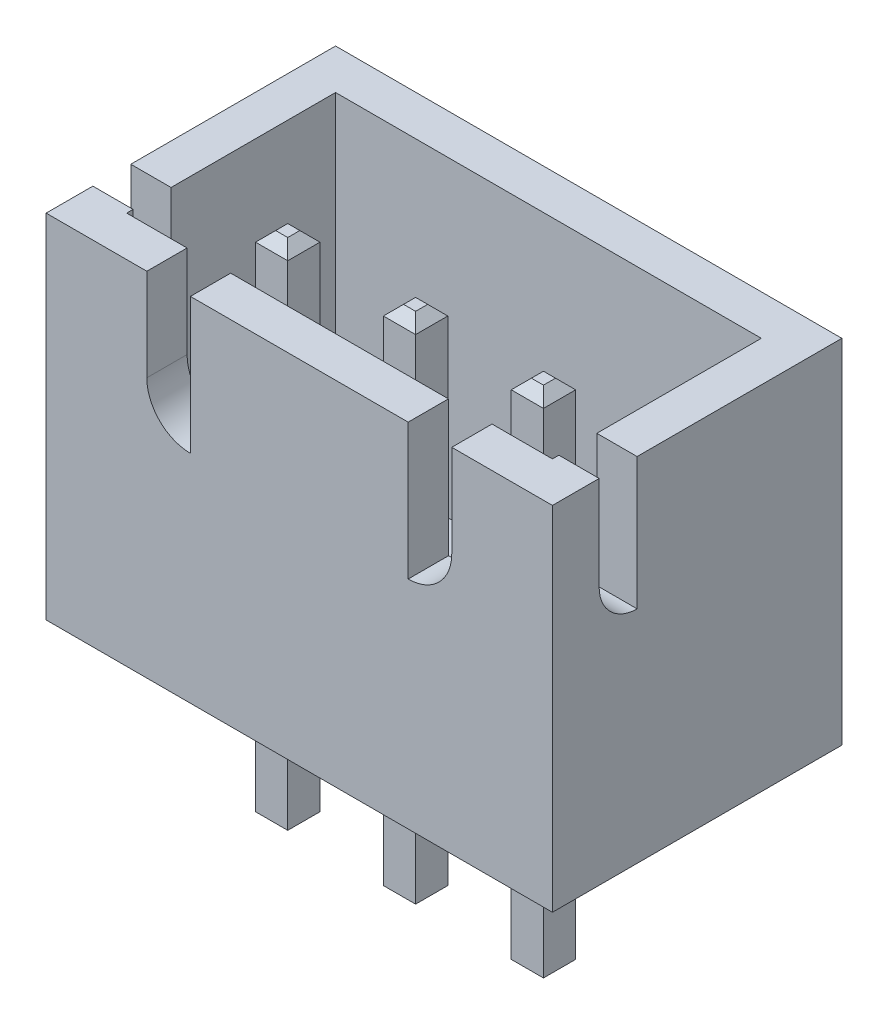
ISO-10303-21;
HEADER;
FILE_DESCRIPTION(('STEP AP214'),'2;1');
FILE_NAME('part.step','',(''),(''),'','','');
FILE_SCHEMA(('AUTOMOTIVE_DESIGN { 1 0 10303 214 1 1 1 1 }'));
ENDSEC;
DATA;
#1=APPLICATION_CONTEXT('core data for automotive mechanical design processes');
#2=APPLICATION_PROTOCOL_DEFINITION('international standard','automotive_design',2000,#1);
#3=PRODUCT_CONTEXT('',#1,'mechanical');
#4=PRODUCT('Part','Part','',(#3));
#5=PRODUCT_RELATED_PRODUCT_CATEGORY('part','',(#4));
#6=PRODUCT_DEFINITION_FORMATION('','',#4);
#7=PRODUCT_DEFINITION_CONTEXT('part definition',#1,'design');
#8=PRODUCT_DEFINITION('design','',#6,#7);
#9=PRODUCT_DEFINITION_SHAPE('','',#8);
#10=(LENGTH_UNIT() NAMED_UNIT(*) SI_UNIT(.MILLI.,.METRE.));
#11=(NAMED_UNIT(*) PLANE_ANGLE_UNIT() SI_UNIT($,.RADIAN.));
#12=(NAMED_UNIT(*) SI_UNIT($,.STERADIAN.) SOLID_ANGLE_UNIT());
#13=UNCERTAINTY_MEASURE_WITH_UNIT(LENGTH_MEASURE(1.E-05),#10,'distance_accuracy_value','');
#14=(GEOMETRIC_REPRESENTATION_CONTEXT(3) GLOBAL_UNCERTAINTY_ASSIGNED_CONTEXT((#13)) GLOBAL_UNIT_ASSIGNED_CONTEXT((#10,
#11,#12)) REPRESENTATION_CONTEXT('',''));
#15=CARTESIAN_POINT('',(0.,0.,0.));
#16=DIRECTION('',(0.,0.,1.));
#17=DIRECTION('',(1.,0.,0.));
#18=AXIS2_PLACEMENT_3D('',#15,#16,#17);
#19=CARTESIAN_POINT('',(0.,7.,0.));
#20=DIRECTION('',(0.,1.,0.));
#21=DIRECTION('',(0.,0.,1.));
#22=AXIS2_PLACEMENT_3D('',#19,#20,#21);
#23=PLANE('',#22);
#24=DIRECTION('',(0.,0.,1.));
#25=VECTOR('',#24,1.);
#26=CARTESIAN_POINT('',(3.02920000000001,7.,-2.876));
#27=LINE('',#26,#25);
#28=CARTESIAN_POINT('',(3.02920000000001,7.,2.075));
#29=VERTEX_POINT('',#28);
#30=CARTESIAN_POINT('',(3.02920000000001,7.,2.875));
#31=VERTEX_POINT('',#30);
#32=EDGE_CURVE('E514',#29,#31,#27,.T.);
#33=ORIENTED_EDGE('',*,*,#32,.T.);
#34=DIRECTION('',(1.,0.,0.));
#35=VECTOR('',#34,1.);
#36=CARTESIAN_POINT('',(-5.02920000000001,7.,2.875));
#37=LINE('',#36,#35);
#38=CARTESIAN_POINT('',(5.02919999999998,7.,2.875));
#39=VERTEX_POINT('',#38);
#40=EDGE_CURVE('E632',#31,#39,#37,.T.);
#41=ORIENTED_EDGE('',*,*,#40,.T.);
#42=DIRECTION('',(0.,0.,-1.));
#43=VECTOR('',#42,1.);
#44=CARTESIAN_POINT('',(5.02919999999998,7.,-2.875));
#45=LINE('',#44,#43);
#46=CARTESIAN_POINT('',(5.02919999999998,7.,1.94691722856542));
#47=VERTEX_POINT('',#46);
#48=EDGE_CURVE('E622',#39,#47,#45,.T.);
#49=ORIENTED_EDGE('',*,*,#48,.T.);
#50=DIRECTION('',(1.,0.,0.));
#51=VECTOR('',#50,1.);
#52=CARTESIAN_POINT('',(-5.02920000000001,7.,1.94691722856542));
#53=LINE('',#52,#51);
#54=CARTESIAN_POINT('',(4.22919999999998,7.,1.94691722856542));
#55=VERTEX_POINT('',#54);
#56=EDGE_CURVE('E557',#55,#47,#53,.T.);
#57=ORIENTED_EDGE('',*,*,#56,.F.);
#58=DIRECTION('',(0.,0.,-1.));
#59=VECTOR('',#58,1.);
#60=CARTESIAN_POINT('',(4.22919999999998,7.,-2.875));
#61=LINE('',#60,#59);
#62=CARTESIAN_POINT('',(4.22919999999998,7.,2.075));
#63=VERTEX_POINT('',#62);
#64=EDGE_CURVE('E609',#63,#55,#61,.T.);
#65=ORIENTED_EDGE('',*,*,#64,.F.);
#66=DIRECTION('',(1.,0.,0.));
#67=VECTOR('',#66,1.);
#68=CARTESIAN_POINT('',(-5.02920000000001,7.,2.075));
#69=LINE('',#68,#67);
#70=EDGE_CURVE('E618',#29,#63,#69,.T.);
#71=ORIENTED_EDGE('',*,*,#70,.F.);
#72=EDGE_LOOP('',(#33,#41,#49,#57,#65,#71));
#73=FACE_BOUND('',#72,.T.);
#74=ADVANCED_FACE('F35',(#73),#23,.T.);
#75=DIRECTION('',(0.,0.,1.));
#76=VECTOR('',#75,1.);
#77=CARTESIAN_POINT('',(-3.02920000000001,7.,-2.876));
#78=LINE('',#77,#76);
#79=CARTESIAN_POINT('',(-3.02920000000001,7.,2.075));
#80=VERTEX_POINT('',#79);
#81=CARTESIAN_POINT('',(-3.02920000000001,7.,2.875));
#82=VERTEX_POINT('',#81);
#83=EDGE_CURVE('E534',#80,#82,#78,.T.);
#84=ORIENTED_EDGE('',*,*,#83,.F.);
#85=CARTESIAN_POINT('',(-4.22920000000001,7.,2.075));
#86=VERTEX_POINT('',#85);
#87=EDGE_CURVE('E598',#86,#80,#69,.T.);
#88=ORIENTED_EDGE('',*,*,#87,.F.);
#89=DIRECTION('',(0.,0.,1.));
#90=VECTOR('',#89,1.);
#91=CARTESIAN_POINT('',(-4.22920000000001,7.,-2.875));
#92=LINE('',#91,#90);
#93=CARTESIAN_POINT('',(-4.22920000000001,7.,1.94691722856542));
#94=VERTEX_POINT('',#93);
#95=EDGE_CURVE('E614',#94,#86,#92,.T.);
#96=ORIENTED_EDGE('',*,*,#95,.F.);
#97=CARTESIAN_POINT('',(-5.02920000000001,7.,1.94691722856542));
#98=VERTEX_POINT('',#97);
#99=EDGE_CURVE('E577',#98,#94,#53,.T.);
#100=ORIENTED_EDGE('',*,*,#99,.F.);
#101=DIRECTION('',(0.,0.,1.));
#102=VECTOR('',#101,1.);
#103=CARTESIAN_POINT('',(-5.02920000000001,7.,-2.875));
#104=LINE('',#103,#102);
#105=CARTESIAN_POINT('',(-5.02920000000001,7.,2.875));
#106=VERTEX_POINT('',#105);
#107=EDGE_CURVE('E628',#98,#106,#104,.T.);
#108=ORIENTED_EDGE('',*,*,#107,.T.);
#109=EDGE_CURVE('E633',#106,#82,#37,.T.);
#110=ORIENTED_EDGE('',*,*,#109,.T.);
#111=EDGE_LOOP('',(#84,#88,#96,#100,#108,#110));
#112=FACE_BOUND('',#111,.T.);
#113=ADVANCED_FACE('F904',(#112),#23,.T.);
#114=DIRECTION('',(1.,0.,0.));
#115=VECTOR('',#114,1.);
#116=CARTESIAN_POINT('',(-5.02920000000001,7.,1.19301282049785));
#117=LINE('',#116,#115);
#118=CARTESIAN_POINT('',(4.22919999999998,7.,1.19301282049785));
#119=VERTEX_POINT('',#118);
#120=CARTESIAN_POINT('',(5.02919999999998,7.,1.19301282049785));
#121=VERTEX_POINT('',#120);
#122=EDGE_CURVE('E568',#119,#121,#117,.T.);
#123=ORIENTED_EDGE('',*,*,#122,.T.);
#124=CARTESIAN_POINT('',(5.02919999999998,7.,-2.875));
#125=VERTEX_POINT('',#124);
#126=EDGE_CURVE('E626',#121,#125,#45,.T.);
#127=ORIENTED_EDGE('',*,*,#126,.T.);
#128=DIRECTION('',(-1.,0.,0.));
#129=VECTOR('',#128,1.);
#130=CARTESIAN_POINT('',(-5.02920000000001,7.,-2.875));
#131=LINE('',#130,#129);
#132=CARTESIAN_POINT('',(-5.02920000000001,7.,-2.875));
#133=VERTEX_POINT('',#132);
#134=EDGE_CURVE('E625',#125,#133,#131,.T.);
#135=ORIENTED_EDGE('',*,*,#134,.T.);
#136=CARTESIAN_POINT('',(-5.02920000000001,7.,1.19301282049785));
#137=VERTEX_POINT('',#136);
#138=EDGE_CURVE('E629',#133,#137,#104,.T.);
#139=ORIENTED_EDGE('',*,*,#138,.T.);
#140=CARTESIAN_POINT('',(-4.22920000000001,7.,1.19301282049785));
#141=VERTEX_POINT('',#140);
#142=EDGE_CURVE('E564',#137,#141,#117,.T.);
#143=ORIENTED_EDGE('',*,*,#142,.T.);
#144=CARTESIAN_POINT('',(-4.22920000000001,7.,-2.075));
#145=VERTEX_POINT('',#144);
#146=EDGE_CURVE('E615',#145,#141,#92,.T.);
#147=ORIENTED_EDGE('',*,*,#146,.F.);
#148=DIRECTION('',(-1.,0.,0.));
#149=VECTOR('',#148,1.);
#150=CARTESIAN_POINT('',(-5.02920000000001,7.,-2.075));
#151=LINE('',#150,#149);
#152=CARTESIAN_POINT('',(4.22919999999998,7.,-2.075));
#153=VERTEX_POINT('',#152);
#154=EDGE_CURVE('E612',#153,#145,#151,.T.);
#155=ORIENTED_EDGE('',*,*,#154,.F.);
#156=EDGE_CURVE('E608',#119,#153,#61,.T.);
#157=ORIENTED_EDGE('',*,*,#156,.F.);
#158=EDGE_LOOP('',(#123,#127,#135,#139,#143,#147,#155,#157));
#159=FACE_BOUND('',#158,.T.);
#160=ADVANCED_FACE('F911',(#159),#23,.T.);
#161=CARTESIAN_POINT('',(5.02919999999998,7.,-2.875));
#162=DIRECTION('',(-1.,0.,0.));
#163=DIRECTION('',(0.,0.,1.));
#164=AXIS2_PLACEMENT_3D('',#161,#162,#163);
#165=PLANE('',#164);
#166=ORIENTED_EDGE('',*,*,#126,.F.);
#167=DIRECTION('',(0.,1.,0.));
#168=VECTOR('',#167,1.);
#169=CARTESIAN_POINT('',(5.02919999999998,7.,1.19301282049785));
#170=LINE('',#169,#168);
#171=CARTESIAN_POINT('',(5.02919999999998,4.37960398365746,1.19301282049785));
#172=VERTEX_POINT('',#171);
#173=EDGE_CURVE('E551',#172,#121,#170,.T.);
#174=ORIENTED_EDGE('',*,*,#173,.F.);
#175=CARTESIAN_POINT('',(5.02919999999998,5.13350839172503,1.19301282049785));
#176=DIRECTION('',(1.,0.,0.));
#177=DIRECTION('',(0.,0.,1.));
#178=AXIS2_PLACEMENT_3D('',#175,#176,#177);
#179=CIRCLE('',#178,0.753904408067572);
#180=CARTESIAN_POINT('',(5.02919999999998,5.13350839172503,1.94691722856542));
#181=VERTEX_POINT('',#180);
#182=EDGE_CURVE('E560',#181,#172,#179,.T.);
#183=ORIENTED_EDGE('',*,*,#182,.F.);
#184=DIRECTION('',(0.,-1.,0.));
#185=VECTOR('',#184,1.);
#186=CARTESIAN_POINT('',(5.02919999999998,5.13350839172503,1.94691722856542));
#187=LINE('',#186,#185);
#188=EDGE_CURVE('E546',#47,#181,#187,.T.);
#189=ORIENTED_EDGE('',*,*,#188,.F.);
#190=ORIENTED_EDGE('',*,*,#48,.F.);
#191=DIRECTION('',(0.,-1.,0.));
#192=VECTOR('',#191,1.);
#193=CARTESIAN_POINT('',(5.02919999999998,7.,2.875));
#194=LINE('',#193,#192);
#195=CARTESIAN_POINT('',(5.02919999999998,0.,2.875));
#196=VERTEX_POINT('',#195);
#197=EDGE_CURVE('E636',#39,#196,#194,.T.);
#198=ORIENTED_EDGE('',*,*,#197,.T.);
#199=DIRECTION('',(0.,0.,-1.));
#200=VECTOR('',#199,1.);
#201=CARTESIAN_POINT('',(5.02919999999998,0.,-2.875));
#202=LINE('',#201,#200);
#203=CARTESIAN_POINT('',(5.02919999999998,0.,-2.875));
#204=VERTEX_POINT('',#203);
#205=EDGE_CURVE('E592',#196,#204,#202,.T.);
#206=ORIENTED_EDGE('',*,*,#205,.T.);
#207=DIRECTION('',(0.,-1.,0.));
#208=VECTOR('',#207,1.);
#209=CARTESIAN_POINT('',(5.02919999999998,7.,-2.875));
#210=LINE('',#209,#208);
#211=EDGE_CURVE('E654',#125,#204,#210,.T.);
#212=ORIENTED_EDGE('',*,*,#211,.F.);
#213=EDGE_LOOP('',(#166,#174,#183,#189,#190,#198,#206,#212));
#214=FACE_BOUND('',#213,.T.);
#215=ADVANCED_FACE('F928',(#214),#165,.F.);
#216=CARTESIAN_POINT('',(-5.02920000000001,7.,-2.875));
#217=DIRECTION('',(0.,0.,1.));
#218=DIRECTION('',(1.,0.,0.));
#219=AXIS2_PLACEMENT_3D('',#216,#217,#218);
#220=PLANE('',#219);
#221=DIRECTION('',(-1.,0.,0.));
#222=VECTOR('',#221,1.);
#223=CARTESIAN_POINT('',(-5.02920000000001,0.,-2.875));
#224=LINE('',#223,#222);
#225=CARTESIAN_POINT('',(-5.02920000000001,0.,-2.875));
#226=VERTEX_POINT('',#225);
#227=EDGE_CURVE('E640',#204,#226,#224,.T.);
#228=ORIENTED_EDGE('',*,*,#227,.T.);
#229=DIRECTION('',(0.,-1.,0.));
#230=VECTOR('',#229,1.);
#231=CARTESIAN_POINT('',(-5.02920000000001,7.,-2.875));
#232=LINE('',#231,#230);
#233=EDGE_CURVE('E651',#133,#226,#232,.T.);
#234=ORIENTED_EDGE('',*,*,#233,.F.);
#235=ORIENTED_EDGE('',*,*,#134,.F.);
#236=ORIENTED_EDGE('',*,*,#211,.T.);
#237=EDGE_LOOP('',(#228,#234,#235,#236));
#238=FACE_BOUND('',#237,.T.);
#239=ADVANCED_FACE('F933',(#238),#220,.F.);
#240=CARTESIAN_POINT('',(-5.02920000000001,7.,-2.875));
#241=DIRECTION('',(1.,0.,0.));
#242=DIRECTION('',(0.,0.,-1.));
#243=AXIS2_PLACEMENT_3D('',#240,#241,#242);
#244=PLANE('',#243);
#245=CARTESIAN_POINT('',(-5.02920000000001,5.13350839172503,1.19301282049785));
#246=DIRECTION('',(1.,0.,0.));
#247=DIRECTION('',(0.,0.,1.));
#248=AXIS2_PLACEMENT_3D('',#245,#246,#247);
#249=CIRCLE('',#248,0.753904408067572);
#250=CARTESIAN_POINT('',(-5.02920000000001,5.13350839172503,1.94691722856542));
#251=VERTEX_POINT('',#250);
#252=CARTESIAN_POINT('',(-5.02920000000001,4.37960398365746,1.19301282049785));
#253=VERTEX_POINT('',#252);
#254=EDGE_CURVE('E550',#251,#253,#249,.T.);
#255=ORIENTED_EDGE('',*,*,#254,.T.);
#256=DIRECTION('',(0.,1.,0.));
#257=VECTOR('',#256,1.);
#258=CARTESIAN_POINT('',(-5.02920000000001,7.,1.19301282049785));
#259=LINE('',#258,#257);
#260=EDGE_CURVE('E554',#253,#137,#259,.T.);
#261=ORIENTED_EDGE('',*,*,#260,.T.);
#262=ORIENTED_EDGE('',*,*,#138,.F.);
#263=ORIENTED_EDGE('',*,*,#233,.T.);
#264=DIRECTION('',(0.,0.,1.));
#265=VECTOR('',#264,1.);
#266=CARTESIAN_POINT('',(-5.02920000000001,0.,-2.875));
#267=LINE('',#266,#265);
#268=CARTESIAN_POINT('',(-5.02920000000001,0.,2.875));
#269=VERTEX_POINT('',#268);
#270=EDGE_CURVE('E642',#226,#269,#267,.T.);
#271=ORIENTED_EDGE('',*,*,#270,.T.);
#272=DIRECTION('',(0.,-1.,0.));
#273=VECTOR('',#272,1.);
#274=CARTESIAN_POINT('',(-5.02920000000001,7.,2.875));
#275=LINE('',#274,#273);
#276=EDGE_CURVE('E648',#106,#269,#275,.T.);
#277=ORIENTED_EDGE('',*,*,#276,.F.);
#278=ORIENTED_EDGE('',*,*,#107,.F.);
#279=DIRECTION('',(0.,-1.,0.));
#280=VECTOR('',#279,1.);
#281=CARTESIAN_POINT('',(-5.02920000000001,5.13350839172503,1.94691722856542));
#282=LINE('',#281,#280);
#283=EDGE_CURVE('E547',#98,#251,#282,.T.);
#284=ORIENTED_EDGE('',*,*,#283,.T.);
#285=EDGE_LOOP('',(#255,#261,#262,#263,#271,#277,#278,#284));
#286=FACE_BOUND('',#285,.T.);
#287=ADVANCED_FACE('F923',(#286),#244,.F.);
#288=CARTESIAN_POINT('',(-5.02920000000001,7.,2.875));
#289=DIRECTION('',(0.,0.,-1.));
#290=DIRECTION('',(-1.,0.,0.));
#291=AXIS2_PLACEMENT_3D('',#288,#289,#290);
#292=PLANE('',#291);
#293=ORIENTED_EDGE('',*,*,#40,.F.);
#294=DIRECTION('',(0.,1.,0.));
#295=VECTOR('',#294,1.);
#296=CARTESIAN_POINT('',(3.02920000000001,7.,2.875));
#297=LINE('',#296,#295);
#298=CARTESIAN_POINT('',(3.02920000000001,5.16630822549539,2.875));
#299=VERTEX_POINT('',#298);
#300=EDGE_CURVE('E503',#299,#31,#297,.T.);
#301=ORIENTED_EDGE('',*,*,#300,.F.);
#302=CARTESIAN_POINT('',(2.16296811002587,5.16630822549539,2.875));
#303=DIRECTION('',(0.,0.,1.));
#304=DIRECTION('',(-1.,0.,0.));
#305=AXIS2_PLACEMENT_3D('',#302,#303,#304);
#306=CIRCLE('',#305,0.866231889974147);
#307=CARTESIAN_POINT('',(2.16296811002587,4.30007633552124,2.875));
#308=VERTEX_POINT('',#307);
#309=EDGE_CURVE('E500',#308,#299,#306,.T.);
#310=ORIENTED_EDGE('',*,*,#309,.F.);
#311=DIRECTION('',(0.,-1.,0.));
#312=VECTOR('',#311,1.);
#313=CARTESIAN_POINT('',(2.16296811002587,4.30007633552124,2.875));
#314=LINE('',#313,#312);
#315=CARTESIAN_POINT('',(2.16296811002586,7.,2.875));
#316=VERTEX_POINT('',#315);
#317=EDGE_CURVE('E505',#316,#308,#314,.T.);
#318=ORIENTED_EDGE('',*,*,#317,.F.);
#319=CARTESIAN_POINT('',(-2.16296811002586,7.,2.875));
#320=VERTEX_POINT('',#319);
#321=EDGE_CURVE('E637',#320,#316,#37,.T.);
#322=ORIENTED_EDGE('',*,*,#321,.F.);
#323=DIRECTION('',(0.,1.,0.));
#324=VECTOR('',#323,1.);
#325=CARTESIAN_POINT('',(-2.16296811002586,4.30007633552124,2.875));
#326=LINE('',#325,#324);
#327=CARTESIAN_POINT('',(-2.16296811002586,4.30007633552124,2.875));
#328=VERTEX_POINT('',#327);
#329=EDGE_CURVE('E532',#328,#320,#326,.T.);
#330=ORIENTED_EDGE('',*,*,#329,.F.);
#331=CARTESIAN_POINT('',(-2.16296811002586,5.16630822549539,2.875));
#332=DIRECTION('',(0.,0.,1.));
#333=DIRECTION('',(1.,0.,0.));
#334=AXIS2_PLACEMENT_3D('',#331,#332,#333);
#335=CIRCLE('',#334,0.866231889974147);
#336=CARTESIAN_POINT('',(-3.02920000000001,5.16630822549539,2.875));
#337=VERTEX_POINT('',#336);
#338=EDGE_CURVE('E529',#337,#328,#335,.T.);
#339=ORIENTED_EDGE('',*,*,#338,.F.);
#340=DIRECTION('',(0.,-1.,0.));
#341=VECTOR('',#340,1.);
#342=CARTESIAN_POINT('',(-3.02920000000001,6.72892261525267,2.875));
#343=LINE('',#342,#341);
#344=EDGE_CURVE('E526',#82,#337,#343,.T.);
#345=ORIENTED_EDGE('',*,*,#344,.F.);
#346=ORIENTED_EDGE('',*,*,#109,.F.);
#347=ORIENTED_EDGE('',*,*,#276,.T.);
#348=DIRECTION('',(1.,0.,0.));
#349=VECTOR('',#348,1.);
#350=CARTESIAN_POINT('',(-5.02920000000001,0.,2.875));
#351=LINE('',#350,#349);
#352=EDGE_CURVE('E644',#269,#196,#351,.T.);
#353=ORIENTED_EDGE('',*,*,#352,.T.);
#354=ORIENTED_EDGE('',*,*,#197,.F.);
#355=EDGE_LOOP('',(#293,#301,#310,#318,#322,#330,#339,#345,#346,#347,#353,#354));
#356=FACE_BOUND('',#355,.T.);
#357=ADVANCED_FACE('F916',(#356),#292,.F.);
#358=DIRECTION('',(0.,0.,1.));
#359=VECTOR('',#358,1.);
#360=CARTESIAN_POINT('',(2.16296811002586,7.,-2.876));
#361=LINE('',#360,#359);
#362=CARTESIAN_POINT('',(2.16296811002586,7.,2.075));
#363=VERTEX_POINT('',#362);
#364=EDGE_CURVE('E512',#363,#316,#361,.T.);
#365=ORIENTED_EDGE('',*,*,#364,.F.);
#366=CARTESIAN_POINT('',(-2.16296811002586,7.,2.075));
#367=VERTEX_POINT('',#366);
#368=EDGE_CURVE('E621',#367,#363,#69,.T.);
#369=ORIENTED_EDGE('',*,*,#368,.F.);
#370=DIRECTION('',(0.,0.,1.));
#371=VECTOR('',#370,1.);
#372=CARTESIAN_POINT('',(-2.16296811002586,7.,-2.876));
#373=LINE('',#372,#371);
#374=EDGE_CURVE('E535',#367,#320,#373,.T.);
#375=ORIENTED_EDGE('',*,*,#374,.T.);
#376=ORIENTED_EDGE('',*,*,#321,.T.);
#377=EDGE_LOOP('',(#365,#369,#375,#376));
#378=FACE_BOUND('',#377,.T.);
#379=ADVANCED_FACE('F907',(#378),#23,.T.);
#380=CARTESIAN_POINT('',(0.,0.,0.));
#381=DIRECTION('',(0.,1.,0.));
#382=DIRECTION('',(0.,0.,1.));
#383=AXIS2_PLACEMENT_3D('',#380,#381,#382);
#384=PLANE('',#383);
#385=DIRECTION('',(0.,0.,-1.));
#386=VECTOR('',#385,1.);
#387=CARTESIAN_POINT('',(2.82079999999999,0.,0.));
#388=LINE('',#387,#386);
#389=CARTESIAN_POINT('',(2.82079999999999,0.,0.844999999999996));
#390=VERTEX_POINT('',#389);
#391=CARTESIAN_POINT('',(2.82079999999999,0.,0.204999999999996));
#392=VERTEX_POINT('',#391);
#393=EDGE_CURVE('E413',#390,#392,#388,.T.);
#394=ORIENTED_EDGE('',*,*,#393,.T.);
#395=DIRECTION('',(-1.,0.,0.));
#396=VECTOR('',#395,1.);
#397=CARTESIAN_POINT('',(0.,0.,0.204999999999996));
#398=LINE('',#397,#396);
#399=CARTESIAN_POINT('',(2.18079999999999,0.,0.204999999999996));
#400=VERTEX_POINT('',#399);
#401=EDGE_CURVE('E441',#392,#400,#398,.T.);
#402=ORIENTED_EDGE('',*,*,#401,.T.);
#403=DIRECTION('',(0.,0.,1.));
#404=VECTOR('',#403,1.);
#405=CARTESIAN_POINT('',(2.18079999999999,0.,0.));
#406=LINE('',#405,#404);
#407=CARTESIAN_POINT('',(2.18079999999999,0.,0.844999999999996));
#408=VERTEX_POINT('',#407);
#409=EDGE_CURVE('E439',#400,#408,#406,.T.);
#410=ORIENTED_EDGE('',*,*,#409,.T.);
#411=DIRECTION('',(1.,0.,0.));
#412=VECTOR('',#411,1.);
#413=CARTESIAN_POINT('',(0.,0.,0.844999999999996));
#414=LINE('',#413,#412);
#415=EDGE_CURVE('E424',#408,#390,#414,.T.);
#416=ORIENTED_EDGE('',*,*,#415,.T.);
#417=EDGE_LOOP('',(#394,#402,#410,#416));
#418=FACE_BOUND('',#417,.T.);
#419=DIRECTION('',(0.,0.,-1.));
#420=VECTOR('',#419,1.);
#421=CARTESIAN_POINT('',(0.280799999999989,0.,0.));
#422=LINE('',#421,#420);
#423=CARTESIAN_POINT('',(0.280799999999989,0.,0.844999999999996));
#424=VERTEX_POINT('',#423);
#425=CARTESIAN_POINT('',(0.280799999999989,0.,0.204999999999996));
#426=VERTEX_POINT('',#425);
#427=EDGE_CURVE('E449',#424,#426,#422,.T.);
#428=ORIENTED_EDGE('',*,*,#427,.T.);
#429=DIRECTION('',(-1.,0.,0.));
#430=VECTOR('',#429,1.);
#431=CARTESIAN_POINT('',(0.,0.,0.204999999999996));
#432=LINE('',#431,#430);
#433=CARTESIAN_POINT('',(-0.359200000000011,0.,0.204999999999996));
#434=VERTEX_POINT('',#433);
#435=EDGE_CURVE('E467',#426,#434,#432,.T.);
#436=ORIENTED_EDGE('',*,*,#435,.T.);
#437=DIRECTION('',(0.,0.,1.));
#438=VECTOR('',#437,1.);
#439=CARTESIAN_POINT('',(-0.359200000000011,0.,0.));
#440=LINE('',#439,#438);
#441=CARTESIAN_POINT('',(-0.359200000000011,0.,0.844999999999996));
#442=VERTEX_POINT('',#441);
#443=EDGE_CURVE('E464',#434,#442,#440,.T.);
#444=ORIENTED_EDGE('',*,*,#443,.T.);
#445=DIRECTION('',(1.,0.,0.));
#446=VECTOR('',#445,1.);
#447=CARTESIAN_POINT('',(0.,0.,0.844999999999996));
#448=LINE('',#447,#446);
#449=EDGE_CURVE('E461',#442,#424,#448,.T.);
#450=ORIENTED_EDGE('',*,*,#449,.T.);
#451=EDGE_LOOP('',(#428,#436,#444,#450));
#452=FACE_BOUND('',#451,.T.);
#453=DIRECTION('',(1.,0.,0.));
#454=VECTOR('',#453,1.);
#455=CARTESIAN_POINT('',(0.,0.,0.844999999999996));
#456=LINE('',#455,#454);
#457=CARTESIAN_POINT('',(-2.89920000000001,0.,0.844999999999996));
#458=VERTEX_POINT('',#457);
#459=CARTESIAN_POINT('',(-2.25920000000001,0.,0.844999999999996));
#460=VERTEX_POINT('',#459);
#461=EDGE_CURVE('E473',#458,#460,#456,.T.);
#462=ORIENTED_EDGE('',*,*,#461,.T.);
#463=DIRECTION('',(0.,0.,-1.));
#464=VECTOR('',#463,1.);
#465=CARTESIAN_POINT('',(-2.25920000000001,0.,0.));
#466=LINE('',#465,#464);
#467=CARTESIAN_POINT('',(-2.25920000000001,0.,0.204999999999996));
#468=VERTEX_POINT('',#467);
#469=EDGE_CURVE('E491',#460,#468,#466,.T.);
#470=ORIENTED_EDGE('',*,*,#469,.T.);
#471=DIRECTION('',(-1.,0.,0.));
#472=VECTOR('',#471,1.);
#473=CARTESIAN_POINT('',(0.,0.,0.204999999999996));
#474=LINE('',#473,#472);
#475=CARTESIAN_POINT('',(-2.89920000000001,0.,0.204999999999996));
#476=VERTEX_POINT('',#475);
#477=EDGE_CURVE('E488',#468,#476,#474,.T.);
#478=ORIENTED_EDGE('',*,*,#477,.T.);
#479=DIRECTION('',(0.,0.,1.));
#480=VECTOR('',#479,1.);
#481=CARTESIAN_POINT('',(-2.89920000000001,0.,0.));
#482=LINE('',#481,#480);
#483=EDGE_CURVE('E485',#476,#458,#482,.T.);
#484=ORIENTED_EDGE('',*,*,#483,.T.);
#485=EDGE_LOOP('',(#462,#470,#478,#484));
#486=FACE_BOUND('',#485,.T.);
#487=ORIENTED_EDGE('',*,*,#205,.F.);
#488=ORIENTED_EDGE('',*,*,#352,.F.);
#489=ORIENTED_EDGE('',*,*,#270,.F.);
#490=ORIENTED_EDGE('',*,*,#227,.F.);
#491=EDGE_LOOP('',(#487,#488,#489,#490));
#492=FACE_BOUND('',#491,.T.);
#493=ADVANCED_FACE('F437',(#418,#452,#486,#492),#384,.F.);
#494=CARTESIAN_POINT('',(4.22919999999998,7.,-2.875));
#495=DIRECTION('',(-1.,0.,0.));
#496=DIRECTION('',(0.,0.,1.));
#497=AXIS2_PLACEMENT_3D('',#494,#495,#496);
#498=PLANE('',#497);
#499=DIRECTION('',(0.,-1.,0.));
#500=VECTOR('',#499,1.);
#501=CARTESIAN_POINT('',(4.22919999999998,7.,1.19301282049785));
#502=LINE('',#501,#500);
#503=CARTESIAN_POINT('',(4.22919999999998,4.37960398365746,1.19301282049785));
#504=VERTEX_POINT('',#503);
#505=EDGE_CURVE('E583',#119,#504,#502,.T.);
#506=ORIENTED_EDGE('',*,*,#505,.F.);
#507=ORIENTED_EDGE('',*,*,#156,.T.);
#508=DIRECTION('',(0.,-1.,0.));
#509=VECTOR('',#508,1.);
#510=CARTESIAN_POINT('',(4.22919999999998,7.,-2.075));
#511=LINE('',#510,#509);
#512=CARTESIAN_POINT('',(4.22919999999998,0.8,-2.075));
#513=VERTEX_POINT('',#512);
#514=EDGE_CURVE('E589',#153,#513,#511,.T.);
#515=ORIENTED_EDGE('',*,*,#514,.T.);
#516=DIRECTION('',(0.,0.,-1.));
#517=VECTOR('',#516,1.);
#518=CARTESIAN_POINT('',(4.22919999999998,0.8,-2.875));
#519=LINE('',#518,#517);
#520=CARTESIAN_POINT('',(4.22919999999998,0.8,2.075));
#521=VERTEX_POINT('',#520);
#522=EDGE_CURVE('E585',#521,#513,#519,.T.);
#523=ORIENTED_EDGE('',*,*,#522,.F.);
#524=DIRECTION('',(0.,-1.,0.));
#525=VECTOR('',#524,1.);
#526=CARTESIAN_POINT('',(4.22919999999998,7.,2.075));
#527=LINE('',#526,#525);
#528=EDGE_CURVE('E594',#63,#521,#527,.T.);
#529=ORIENTED_EDGE('',*,*,#528,.F.);
#530=ORIENTED_EDGE('',*,*,#64,.T.);
#531=DIRECTION('',(0.,1.,0.));
#532=VECTOR('',#531,1.);
#533=CARTESIAN_POINT('',(4.22919999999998,7.,1.94691722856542));
#534=LINE('',#533,#532);
#535=CARTESIAN_POINT('',(4.22919999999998,5.13350839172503,1.94691722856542));
#536=VERTEX_POINT('',#535);
#537=EDGE_CURVE('E567',#536,#55,#534,.T.);
#538=ORIENTED_EDGE('',*,*,#537,.F.);
#539=CARTESIAN_POINT('',(4.22919999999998,5.13350839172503,1.19301282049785));
#540=DIRECTION('',(-1.,0.,0.));
#541=DIRECTION('',(0.,0.,1.));
#542=AXIS2_PLACEMENT_3D('',#539,#540,#541);
#543=CIRCLE('',#542,0.753904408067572);
#544=EDGE_CURVE('E580',#504,#536,#543,.T.);
#545=ORIENTED_EDGE('',*,*,#544,.F.);
#546=EDGE_LOOP('',(#506,#507,#515,#523,#529,#530,#538,#545));
#547=FACE_BOUND('',#546,.T.);
#548=ADVANCED_FACE('F922',(#547),#498,.T.);
#549=CARTESIAN_POINT('',(-5.02920000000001,7.,-2.075));
#550=DIRECTION('',(0.,0.,1.));
#551=DIRECTION('',(1.,0.,0.));
#552=AXIS2_PLACEMENT_3D('',#549,#550,#551);
#553=PLANE('',#552);
#554=DIRECTION('',(-1.,0.,0.));
#555=VECTOR('',#554,1.);
#556=CARTESIAN_POINT('',(-5.02920000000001,0.8,-2.075));
#557=LINE('',#556,#555);
#558=CARTESIAN_POINT('',(-4.22920000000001,0.8,-2.075));
#559=VERTEX_POINT('',#558);
#560=EDGE_CURVE('E588',#513,#559,#557,.T.);
#561=ORIENTED_EDGE('',*,*,#560,.F.);
#562=ORIENTED_EDGE('',*,*,#514,.F.);
#563=ORIENTED_EDGE('',*,*,#154,.T.);
#564=DIRECTION('',(0.,-1.,0.));
#565=VECTOR('',#564,1.);
#566=CARTESIAN_POINT('',(-4.22920000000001,7.,-2.075));
#567=LINE('',#566,#565);
#568=EDGE_CURVE('E593',#145,#559,#567,.T.);
#569=ORIENTED_EDGE('',*,*,#568,.T.);
#570=EDGE_LOOP('',(#561,#562,#563,#569));
#571=FACE_BOUND('',#570,.T.);
#572=ADVANCED_FACE('F966',(#571),#553,.T.);
#573=CARTESIAN_POINT('',(-4.22920000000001,7.,-2.875));
#574=DIRECTION('',(1.,0.,0.));
#575=DIRECTION('',(0.,0.,-1.));
#576=AXIS2_PLACEMENT_3D('',#573,#574,#575);
#577=PLANE('',#576);
#578=DIRECTION('',(0.,1.,0.));
#579=VECTOR('',#578,1.);
#580=CARTESIAN_POINT('',(-4.22920000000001,7.,1.19301282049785));
#581=LINE('',#580,#579);
#582=CARTESIAN_POINT('',(-4.22920000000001,4.37960398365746,1.19301282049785));
#583=VERTEX_POINT('',#582);
#584=EDGE_CURVE('E661',#583,#141,#581,.T.);
#585=ORIENTED_EDGE('',*,*,#584,.F.);
#586=CARTESIAN_POINT('',(-4.22920000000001,5.13350839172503,1.19301282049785));
#587=DIRECTION('',(1.,0.,0.));
#588=DIRECTION('',(0.,0.,-1.));
#589=AXIS2_PLACEMENT_3D('',#586,#587,#588);
#590=CIRCLE('',#589,0.753904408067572);
#591=CARTESIAN_POINT('',(-4.22920000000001,5.13350839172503,1.94691722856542));
#592=VERTEX_POINT('',#591);
#593=EDGE_CURVE('E659',#592,#583,#590,.T.);
#594=ORIENTED_EDGE('',*,*,#593,.F.);
#595=DIRECTION('',(0.,-1.,0.));
#596=VECTOR('',#595,1.);
#597=CARTESIAN_POINT('',(-4.22920000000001,7.,1.94691722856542));
#598=LINE('',#597,#596);
#599=EDGE_CURVE('E657',#94,#592,#598,.T.);
#600=ORIENTED_EDGE('',*,*,#599,.F.);
#601=ORIENTED_EDGE('',*,*,#95,.T.);
#602=DIRECTION('',(0.,-1.,0.));
#603=VECTOR('',#602,1.);
#604=CARTESIAN_POINT('',(-4.22920000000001,7.,2.075));
#605=LINE('',#604,#603);
#606=CARTESIAN_POINT('',(-4.22920000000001,0.8,2.075));
#607=VERTEX_POINT('',#606);
#608=EDGE_CURVE('E597',#86,#607,#605,.T.);
#609=ORIENTED_EDGE('',*,*,#608,.T.);
#610=DIRECTION('',(0.,0.,1.));
#611=VECTOR('',#610,1.);
#612=CARTESIAN_POINT('',(-4.22920000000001,0.8,-2.875));
#613=LINE('',#612,#611);
#614=EDGE_CURVE('E600',#559,#607,#613,.T.);
#615=ORIENTED_EDGE('',*,*,#614,.F.);
#616=ORIENTED_EDGE('',*,*,#568,.F.);
#617=ORIENTED_EDGE('',*,*,#146,.T.);
#618=EDGE_LOOP('',(#585,#594,#600,#601,#609,#615,#616,#617));
#619=FACE_BOUND('',#618,.T.);
#620=ADVANCED_FACE('F960',(#619),#577,.T.);
#621=CARTESIAN_POINT('',(-5.02920000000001,7.,2.075));
#622=DIRECTION('',(0.,0.,-1.));
#623=DIRECTION('',(-1.,0.,0.));
#624=AXIS2_PLACEMENT_3D('',#621,#622,#623);
#625=PLANE('',#624);
#626=DIRECTION('',(0.,1.,0.));
#627=VECTOR('',#626,1.);
#628=CARTESIAN_POINT('',(3.02920000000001,7.,2.075));
#629=LINE('',#628,#627);
#630=CARTESIAN_POINT('',(3.02920000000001,5.16630822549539,2.075));
#631=VERTEX_POINT('',#630);
#632=EDGE_CURVE('E511',#631,#29,#629,.T.);
#633=ORIENTED_EDGE('',*,*,#632,.T.);
#634=ORIENTED_EDGE('',*,*,#70,.T.);
#635=ORIENTED_EDGE('',*,*,#528,.T.);
#636=DIRECTION('',(1.,0.,0.));
#637=VECTOR('',#636,1.);
#638=CARTESIAN_POINT('',(-5.02920000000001,0.8,2.075));
#639=LINE('',#638,#637);
#640=EDGE_CURVE('E604',#607,#521,#639,.T.);
#641=ORIENTED_EDGE('',*,*,#640,.F.);
#642=ORIENTED_EDGE('',*,*,#608,.F.);
#643=ORIENTED_EDGE('',*,*,#87,.T.);
#644=DIRECTION('',(0.,-1.,0.));
#645=VECTOR('',#644,1.);
#646=CARTESIAN_POINT('',(-3.02920000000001,6.72892261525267,2.075));
#647=LINE('',#646,#645);
#648=CARTESIAN_POINT('',(-3.02920000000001,5.16630822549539,2.075));
#649=VERTEX_POINT('',#648);
#650=EDGE_CURVE('E538',#80,#649,#647,.T.);
#651=ORIENTED_EDGE('',*,*,#650,.T.);
#652=CARTESIAN_POINT('',(-2.16296811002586,5.16630822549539,2.075));
#653=DIRECTION('',(0.,0.,-1.));
#654=DIRECTION('',(-1.,0.,0.));
#655=AXIS2_PLACEMENT_3D('',#652,#653,#654);
#656=CIRCLE('',#655,0.866231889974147);
#657=CARTESIAN_POINT('',(-2.16296811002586,4.30007633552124,2.075));
#658=VERTEX_POINT('',#657);
#659=EDGE_CURVE('E520',#649,#658,#656,.F.);
#660=ORIENTED_EDGE('',*,*,#659,.T.);
#661=DIRECTION('',(0.,1.,0.));
#662=VECTOR('',#661,1.);
#663=CARTESIAN_POINT('',(-2.16296811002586,4.30007633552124,2.075));
#664=LINE('',#663,#662);
#665=EDGE_CURVE('E523',#658,#367,#664,.T.);
#666=ORIENTED_EDGE('',*,*,#665,.T.);
#667=ORIENTED_EDGE('',*,*,#368,.T.);
#668=DIRECTION('',(0.,-1.,0.));
#669=VECTOR('',#668,1.);
#670=CARTESIAN_POINT('',(2.16296811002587,4.30007633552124,2.075));
#671=LINE('',#670,#669);
#672=CARTESIAN_POINT('',(2.16296811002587,4.30007633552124,2.075));
#673=VERTEX_POINT('',#672);
#674=EDGE_CURVE('E497',#363,#673,#671,.T.);
#675=ORIENTED_EDGE('',*,*,#674,.T.);
#676=CARTESIAN_POINT('',(2.16296811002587,5.16630822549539,2.075));
#677=DIRECTION('',(0.,0.,-1.));
#678=DIRECTION('',(-1.,0.,0.));
#679=AXIS2_PLACEMENT_3D('',#676,#677,#678);
#680=CIRCLE('',#679,0.866231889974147);
#681=EDGE_CURVE('E494',#673,#631,#680,.F.);
#682=ORIENTED_EDGE('',*,*,#681,.T.);
#683=EDGE_LOOP('',(#633,#634,#635,#641,#642,#643,#651,#660,#666,#667,#675,#682));
#684=FACE_BOUND('',#683,.T.);
#685=ADVANCED_FACE('F973',(#684),#625,.T.);
#686=CARTESIAN_POINT('',(0.,0.8,0.));
#687=DIRECTION('',(0.,1.,0.));
#688=DIRECTION('',(0.,0.,1.));
#689=AXIS2_PLACEMENT_3D('',#686,#687,#688);
#690=PLANE('',#689);
#691=DIRECTION('',(-1.,0.,0.));
#692=VECTOR('',#691,1.);
#693=CARTESIAN_POINT('',(0.,0.8,0.204999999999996));
#694=LINE('',#693,#692);
#695=CARTESIAN_POINT('',(2.82079999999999,0.8,0.204999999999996));
#696=VERTEX_POINT('',#695);
#697=CARTESIAN_POINT('',(2.18079999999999,0.8,0.204999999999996));
#698=VERTEX_POINT('',#697);
#699=EDGE_CURVE('E696',#696,#698,#694,.T.);
#700=ORIENTED_EDGE('',*,*,#699,.F.);
#701=DIRECTION('',(0.,0.,-1.));
#702=VECTOR('',#701,1.);
#703=CARTESIAN_POINT('',(2.82079999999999,0.8,0.));
#704=LINE('',#703,#702);
#705=CARTESIAN_POINT('',(2.82079999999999,0.8,0.844999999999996));
#706=VERTEX_POINT('',#705);
#707=EDGE_CURVE('E687',#706,#696,#704,.T.);
#708=ORIENTED_EDGE('',*,*,#707,.F.);
#709=DIRECTION('',(1.,0.,0.));
#710=VECTOR('',#709,1.);
#711=CARTESIAN_POINT('',(0.,0.8,0.844999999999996));
#712=LINE('',#711,#710);
#713=CARTESIAN_POINT('',(2.18079999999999,0.8,0.844999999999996));
#714=VERTEX_POINT('',#713);
#715=EDGE_CURVE('E690',#714,#706,#712,.T.);
#716=ORIENTED_EDGE('',*,*,#715,.F.);
#717=DIRECTION('',(0.,0.,1.));
#718=VECTOR('',#717,1.);
#719=CARTESIAN_POINT('',(2.18079999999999,0.8,0.));
#720=LINE('',#719,#718);
#721=EDGE_CURVE('E693',#698,#714,#720,.T.);
#722=ORIENTED_EDGE('',*,*,#721,.F.);
#723=EDGE_LOOP('',(#700,#708,#716,#722));
#724=FACE_BOUND('',#723,.T.);
#725=DIRECTION('',(-1.,0.,0.));
#726=VECTOR('',#725,1.);
#727=CARTESIAN_POINT('',(0.,0.8,0.204999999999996));
#728=LINE('',#727,#726);
#729=CARTESIAN_POINT('',(0.280799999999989,0.8,0.204999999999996));
#730=VERTEX_POINT('',#729);
#731=CARTESIAN_POINT('',(-0.359200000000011,0.8,0.204999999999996));
#732=VERTEX_POINT('',#731);
#733=EDGE_CURVE('E684',#730,#732,#728,.T.);
#734=ORIENTED_EDGE('',*,*,#733,.F.);
#735=DIRECTION('',(0.,0.,-1.));
#736=VECTOR('',#735,1.);
#737=CARTESIAN_POINT('',(0.280799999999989,0.8,0.));
#738=LINE('',#737,#736);
#739=CARTESIAN_POINT('',(0.280799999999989,0.8,0.844999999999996));
#740=VERTEX_POINT('',#739);
#741=EDGE_CURVE('E675',#740,#730,#738,.T.);
#742=ORIENTED_EDGE('',*,*,#741,.F.);
#743=DIRECTION('',(1.,0.,0.));
#744=VECTOR('',#743,1.);
#745=CARTESIAN_POINT('',(0.,0.8,0.844999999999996));
#746=LINE('',#745,#744);
#747=CARTESIAN_POINT('',(-0.359200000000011,0.8,0.844999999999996));
#748=VERTEX_POINT('',#747);
#749=EDGE_CURVE('E678',#748,#740,#746,.T.);
#750=ORIENTED_EDGE('',*,*,#749,.F.);
#751=DIRECTION('',(0.,0.,1.));
#752=VECTOR('',#751,1.);
#753=CARTESIAN_POINT('',(-0.359200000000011,0.8,0.));
#754=LINE('',#753,#752);
#755=EDGE_CURVE('E681',#732,#748,#754,.T.);
#756=ORIENTED_EDGE('',*,*,#755,.F.);
#757=EDGE_LOOP('',(#734,#742,#750,#756));
#758=FACE_BOUND('',#757,.T.);
#759=DIRECTION('',(0.,0.,-1.));
#760=VECTOR('',#759,1.);
#761=CARTESIAN_POINT('',(-2.25920000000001,0.8,0.));
#762=LINE('',#761,#760);
#763=CARTESIAN_POINT('',(-2.25920000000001,0.8,0.844999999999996));
#764=VERTEX_POINT('',#763);
#765=CARTESIAN_POINT('',(-2.25920000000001,0.8,0.204999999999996));
#766=VERTEX_POINT('',#765);
#767=EDGE_CURVE('E672',#764,#766,#762,.T.);
#768=ORIENTED_EDGE('',*,*,#767,.F.);
#769=DIRECTION('',(1.,0.,0.));
#770=VECTOR('',#769,1.);
#771=CARTESIAN_POINT('',(0.,0.8,0.844999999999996));
#772=LINE('',#771,#770);
#773=CARTESIAN_POINT('',(-2.89920000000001,0.8,0.844999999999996));
#774=VERTEX_POINT('',#773);
#775=EDGE_CURVE('E663',#774,#764,#772,.T.);
#776=ORIENTED_EDGE('',*,*,#775,.F.);
#777=DIRECTION('',(0.,0.,1.));
#778=VECTOR('',#777,1.);
#779=CARTESIAN_POINT('',(-2.89920000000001,0.8,0.));
#780=LINE('',#779,#778);
#781=CARTESIAN_POINT('',(-2.89920000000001,0.8,0.204999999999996));
#782=VERTEX_POINT('',#781);
#783=EDGE_CURVE('E666',#782,#774,#780,.T.);
#784=ORIENTED_EDGE('',*,*,#783,.F.);
#785=DIRECTION('',(-1.,0.,0.));
#786=VECTOR('',#785,1.);
#787=CARTESIAN_POINT('',(0.,0.8,0.204999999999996));
#788=LINE('',#787,#786);
#789=EDGE_CURVE('E669',#766,#782,#788,.T.);
#790=ORIENTED_EDGE('',*,*,#789,.F.);
#791=EDGE_LOOP('',(#768,#776,#784,#790));
#792=FACE_BOUND('',#791,.T.);
#793=ORIENTED_EDGE('',*,*,#522,.T.);
#794=ORIENTED_EDGE('',*,*,#560,.T.);
#795=ORIENTED_EDGE('',*,*,#614,.T.);
#796=ORIENTED_EDGE('',*,*,#640,.T.);
#797=EDGE_LOOP('',(#793,#794,#795,#796));
#798=FACE_BOUND('',#797,.T.);
#799=ADVANCED_FACE('F886',(#724,#758,#792,#798),#690,.T.);
#800=CARTESIAN_POINT('',(-5.02920000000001,5.13350839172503,1.94691722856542));
#801=DIRECTION('',(0.,0.,1.));
#802=DIRECTION('',(1.,0.,0.));
#803=AXIS2_PLACEMENT_3D('',#800,#801,#802);
#804=PLANE('',#803);
#805=ORIENTED_EDGE('',*,*,#599,.T.);
#806=DIRECTION('',(1.,0.,0.));
#807=VECTOR('',#806,1.);
#808=CARTESIAN_POINT('',(-5.02920000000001,5.13350839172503,1.94691722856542));
#809=LINE('',#808,#807);
#810=EDGE_CURVE('E573',#251,#592,#809,.T.);
#811=ORIENTED_EDGE('',*,*,#810,.F.);
#812=ORIENTED_EDGE('',*,*,#283,.F.);
#813=ORIENTED_EDGE('',*,*,#99,.T.);
#814=EDGE_LOOP('',(#805,#811,#812,#813));
#815=FACE_BOUND('',#814,.T.);
#816=ADVANCED_FACE('F1000',(#815),#804,.F.);
#817=CARTESIAN_POINT('',(-5.02920000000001,5.13350839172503,1.19301282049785));
#818=DIRECTION('',(1.,0.,0.));
#819=DIRECTION('',(0.,0.,-1.));
#820=AXIS2_PLACEMENT_3D('',#817,#818,#819);
#821=CYLINDRICAL_SURFACE('',#820,0.753904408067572);
#822=ORIENTED_EDGE('',*,*,#593,.T.);
#823=DIRECTION('',(1.,0.,0.));
#824=VECTOR('',#823,1.);
#825=CARTESIAN_POINT('',(-5.02920000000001,4.37960398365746,1.19301282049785));
#826=LINE('',#825,#824);
#827=EDGE_CURVE('E569',#253,#583,#826,.T.);
#828=ORIENTED_EDGE('',*,*,#827,.F.);
#829=ORIENTED_EDGE('',*,*,#254,.F.);
#830=ORIENTED_EDGE('',*,*,#810,.T.);
#831=EDGE_LOOP('',(#822,#828,#829,#830));
#832=FACE_BOUND('',#831,.T.);
#833=ADVANCED_FACE('F994',(#832),#821,.F.);
#834=CARTESIAN_POINT('',(-5.02920000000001,7.,1.19301282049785));
#835=DIRECTION('',(0.,0.,-1.));
#836=DIRECTION('',(-1.,0.,0.));
#837=AXIS2_PLACEMENT_3D('',#834,#835,#836);
#838=PLANE('',#837);
#839=ORIENTED_EDGE('',*,*,#584,.T.);
#840=ORIENTED_EDGE('',*,*,#142,.F.);
#841=ORIENTED_EDGE('',*,*,#260,.F.);
#842=ORIENTED_EDGE('',*,*,#827,.T.);
#843=EDGE_LOOP('',(#839,#840,#841,#842));
#844=FACE_BOUND('',#843,.T.);
#845=ADVANCED_FACE('F956',(#844),#838,.F.);
#846=ORIENTED_EDGE('',*,*,#505,.T.);
#847=EDGE_CURVE('E572',#504,#172,#826,.T.);
#848=ORIENTED_EDGE('',*,*,#847,.T.);
#849=ORIENTED_EDGE('',*,*,#173,.T.);
#850=ORIENTED_EDGE('',*,*,#122,.F.);
#851=EDGE_LOOP('',(#846,#848,#849,#850));
#852=FACE_BOUND('',#851,.T.);
#853=ADVANCED_FACE('F986',(#852),#838,.F.);
#854=ORIENTED_EDGE('',*,*,#544,.T.);
#855=EDGE_CURVE('E576',#536,#181,#809,.T.);
#856=ORIENTED_EDGE('',*,*,#855,.T.);
#857=ORIENTED_EDGE('',*,*,#182,.T.);
#858=ORIENTED_EDGE('',*,*,#847,.F.);
#859=EDGE_LOOP('',(#854,#856,#857,#858));
#860=FACE_BOUND('',#859,.T.);
#861=ADVANCED_FACE('F984',(#860),#821,.F.);
#862=ORIENTED_EDGE('',*,*,#537,.T.);
#863=ORIENTED_EDGE('',*,*,#56,.T.);
#864=ORIENTED_EDGE('',*,*,#188,.T.);
#865=ORIENTED_EDGE('',*,*,#855,.F.);
#866=EDGE_LOOP('',(#862,#863,#864,#865));
#867=FACE_BOUND('',#866,.T.);
#868=ADVANCED_FACE('F981',(#867),#804,.F.);
#869=CARTESIAN_POINT('',(-3.02920000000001,6.72892261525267,-2.876));
#870=DIRECTION('',(-1.,0.,0.));
#871=DIRECTION('',(0.,0.,1.));
#872=AXIS2_PLACEMENT_3D('',#869,#870,#871);
#873=PLANE('',#872);
#874=ORIENTED_EDGE('',*,*,#83,.T.);
#875=ORIENTED_EDGE('',*,*,#344,.T.);
#876=DIRECTION('',(0.,0.,1.));
#877=VECTOR('',#876,1.);
#878=CARTESIAN_POINT('',(-3.02920000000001,5.16630822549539,-2.876));
#879=LINE('',#878,#877);
#880=EDGE_CURVE('E541',#649,#337,#879,.T.);
#881=ORIENTED_EDGE('',*,*,#880,.F.);
#882=ORIENTED_EDGE('',*,*,#650,.F.);
#883=EDGE_LOOP('',(#874,#875,#881,#882));
#884=FACE_BOUND('',#883,.T.);
#885=ADVANCED_FACE('F996',(#884),#873,.F.);
#886=CARTESIAN_POINT('',(-2.16296811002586,5.16630822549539,-2.876));
#887=DIRECTION('',(0.,0.,1.));
#888=DIRECTION('',(1.,0.,0.));
#889=AXIS2_PLACEMENT_3D('',#886,#887,#888);
#890=CYLINDRICAL_SURFACE('',#889,0.866231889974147);
#891=ORIENTED_EDGE('',*,*,#880,.T.);
#892=ORIENTED_EDGE('',*,*,#338,.T.);
#893=DIRECTION('',(0.,0.,1.));
#894=VECTOR('',#893,1.);
#895=CARTESIAN_POINT('',(-2.16296811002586,4.30007633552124,-2.876));
#896=LINE('',#895,#894);
#897=EDGE_CURVE('E539',#658,#328,#896,.T.);
#898=ORIENTED_EDGE('',*,*,#897,.F.);
#899=ORIENTED_EDGE('',*,*,#659,.F.);
#900=EDGE_LOOP('',(#891,#892,#898,#899));
#901=FACE_BOUND('',#900,.T.);
#902=ADVANCED_FACE('F1571',(#901),#890,.F.);
#903=CARTESIAN_POINT('',(-2.16296811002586,4.30007633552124,-2.876));
#904=DIRECTION('',(1.,0.,0.));
#905=DIRECTION('',(0.,0.,-1.));
#906=AXIS2_PLACEMENT_3D('',#903,#904,#905);
#907=PLANE('',#906);
#908=ORIENTED_EDGE('',*,*,#897,.T.);
#909=ORIENTED_EDGE('',*,*,#329,.T.);
#910=ORIENTED_EDGE('',*,*,#374,.F.);
#911=ORIENTED_EDGE('',*,*,#665,.F.);
#912=EDGE_LOOP('',(#908,#909,#910,#911));
#913=FACE_BOUND('',#912,.T.);
#914=ADVANCED_FACE('F1560',(#913),#907,.F.);
#915=CARTESIAN_POINT('',(3.02920000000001,7.,-2.876));
#916=DIRECTION('',(1.,0.,0.));
#917=DIRECTION('',(0.,0.,-1.));
#918=AXIS2_PLACEMENT_3D('',#915,#916,#917);
#919=PLANE('',#918);
#920=DIRECTION('',(0.,0.,1.));
#921=VECTOR('',#920,1.);
#922=CARTESIAN_POINT('',(3.02920000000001,5.16630822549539,-2.876));
#923=LINE('',#922,#921);
#924=EDGE_CURVE('E508',#631,#299,#923,.T.);
#925=ORIENTED_EDGE('',*,*,#924,.T.);
#926=ORIENTED_EDGE('',*,*,#300,.T.);
#927=ORIENTED_EDGE('',*,*,#32,.F.);
#928=ORIENTED_EDGE('',*,*,#632,.F.);
#929=EDGE_LOOP('',(#925,#926,#927,#928));
#930=FACE_BOUND('',#929,.T.);
#931=ADVANCED_FACE('F1551',(#930),#919,.F.);
#932=CARTESIAN_POINT('',(2.16296811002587,4.30007633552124,-2.876));
#933=DIRECTION('',(-1.,0.,0.));
#934=DIRECTION('',(0.,-1.,0.));
#935=AXIS2_PLACEMENT_3D('',#932,#933,#934);
#936=PLANE('',#935);
#937=ORIENTED_EDGE('',*,*,#364,.T.);
#938=ORIENTED_EDGE('',*,*,#317,.T.);
#939=DIRECTION('',(0.,0.,1.));
#940=VECTOR('',#939,1.);
#941=CARTESIAN_POINT('',(2.16296811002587,4.30007633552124,-2.876));
#942=LINE('',#941,#940);
#943=EDGE_CURVE('E509',#673,#308,#942,.T.);
#944=ORIENTED_EDGE('',*,*,#943,.F.);
#945=ORIENTED_EDGE('',*,*,#674,.F.);
#946=EDGE_LOOP('',(#937,#938,#944,#945));
#947=FACE_BOUND('',#946,.T.);
#948=ADVANCED_FACE('F1541',(#947),#936,.F.);
#949=CARTESIAN_POINT('',(2.16296811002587,5.16630822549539,-2.876));
#950=DIRECTION('',(0.,0.,1.));
#951=DIRECTION('',(1.,0.,0.));
#952=AXIS2_PLACEMENT_3D('',#949,#950,#951);
#953=CYLINDRICAL_SURFACE('',#952,0.866231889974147);
#954=ORIENTED_EDGE('',*,*,#943,.T.);
#955=ORIENTED_EDGE('',*,*,#309,.T.);
#956=ORIENTED_EDGE('',*,*,#924,.F.);
#957=ORIENTED_EDGE('',*,*,#681,.F.);
#958=EDGE_LOOP('',(#954,#955,#956,#957));
#959=FACE_BOUND('',#958,.T.);
#960=ADVANCED_FACE('F1084',(#959),#953,.F.);
#961=CARTESIAN_POINT('',(0.,6.75,0.));
#962=DIRECTION('',(0.,-1.,0.));
#963=DIRECTION('',(0.,0.,-1.));
#964=AXIS2_PLACEMENT_3D('',#961,#962,#963);
#965=PLANE('',#964);
#966=DIRECTION('',(0.,0.,1.));
#967=VECTOR('',#966,1.);
#968=CARTESIAN_POINT('',(-2.69920000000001,6.75,0.844999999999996));
#969=LINE('',#968,#967);
#970=CARTESIAN_POINT('',(-2.69920000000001,6.75,0.404999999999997));
#971=VERTEX_POINT('',#970);
#972=CARTESIAN_POINT('',(-2.69920000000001,6.75,0.644999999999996));
#973=VERTEX_POINT('',#972);
#974=EDGE_CURVE('E795',#971,#973,#969,.T.);
#975=ORIENTED_EDGE('',*,*,#974,.T.);
#976=DIRECTION('',(1.,0.,0.));
#977=VECTOR('',#976,1.);
#978=CARTESIAN_POINT('',(-2.25920000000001,6.75,0.644999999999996));
#979=LINE('',#978,#977);
#980=CARTESIAN_POINT('',(-2.45920000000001,6.75,0.644999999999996));
#981=VERTEX_POINT('',#980);
#982=EDGE_CURVE('E797',#973,#981,#979,.T.);
#983=ORIENTED_EDGE('',*,*,#982,.T.);
#984=DIRECTION('',(0.,0.,-1.));
#985=VECTOR('',#984,1.);
#986=CARTESIAN_POINT('',(-2.45920000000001,6.75,0.204999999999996));
#987=LINE('',#986,#985);
#988=CARTESIAN_POINT('',(-2.45920000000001,6.75,0.404999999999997));
#989=VERTEX_POINT('',#988);
#990=EDGE_CURVE('E791',#981,#989,#987,.T.);
#991=ORIENTED_EDGE('',*,*,#990,.T.);
#992=DIRECTION('',(-1.,0.,0.));
#993=VECTOR('',#992,1.);
#994=CARTESIAN_POINT('',(-2.89920000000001,6.75,0.404999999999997));
#995=LINE('',#994,#993);
#996=EDGE_CURVE('E793',#989,#971,#995,.T.);
#997=ORIENTED_EDGE('',*,*,#996,.T.);
#998=EDGE_LOOP('',(#975,#983,#991,#997));
#999=FACE_BOUND('',#998,.T.);
#1000=ADVANCED_FACE('F870',(#999),#965,.F.);
#1001=CARTESIAN_POINT('',(-2.89920000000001,6.75,0.844999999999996));
#1002=DIRECTION('',(0.,0.,1.));
#1003=DIRECTION('',(1.,0.,0.));
#1004=AXIS2_PLACEMENT_3D('',#1001,#1002,#1003);
#1005=PLANE('',#1004);
#1006=DIRECTION('',(0.,-1.,0.));
#1007=VECTOR('',#1006,1.);
#1008=CARTESIAN_POINT('',(-2.25920000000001,6.75,0.844999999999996));
#1009=LINE('',#1008,#1007);
#1010=CARTESIAN_POINT('',(-2.25920000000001,6.55,0.844999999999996));
#1011=VERTEX_POINT('',#1010);
#1012=EDGE_CURVE('E481',#1011,#764,#1009,.T.);
#1013=ORIENTED_EDGE('',*,*,#1012,.F.);
#1014=DIRECTION('',(-1.,0.,0.));
#1015=VECTOR('',#1014,1.);
#1016=CARTESIAN_POINT('',(-2.89920000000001,6.55,0.844999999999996));
#1017=LINE('',#1016,#1015);
#1018=CARTESIAN_POINT('',(-2.89920000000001,6.55,0.844999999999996));
#1019=VERTEX_POINT('',#1018);
#1020=EDGE_CURVE('E788',#1011,#1019,#1017,.T.);
#1021=ORIENTED_EDGE('',*,*,#1020,.T.);
#1022=DIRECTION('',(0.,-1.,0.));
#1023=VECTOR('',#1022,1.);
#1024=CARTESIAN_POINT('',(-2.89920000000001,6.75,0.844999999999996));
#1025=LINE('',#1024,#1023);
#1026=EDGE_CURVE('E478',#1019,#774,#1025,.T.);
#1027=ORIENTED_EDGE('',*,*,#1026,.T.);
#1028=ORIENTED_EDGE('',*,*,#775,.T.);
#1029=EDGE_LOOP('',(#1013,#1021,#1027,#1028));
#1030=FACE_BOUND('',#1029,.T.);
#1031=ADVANCED_FACE('F879',(#1030),#1005,.T.);
#1032=CARTESIAN_POINT('',(-2.89920000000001,6.75,0.844999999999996));
#1033=DIRECTION('',(-1.,0.,0.));
#1034=DIRECTION('',(0.,0.,1.));
#1035=AXIS2_PLACEMENT_3D('',#1032,#1033,#1034);
#1036=PLANE('',#1035);
#1037=ORIENTED_EDGE('',*,*,#1026,.F.);
#1038=DIRECTION('',(0.,0.,-1.));
#1039=VECTOR('',#1038,1.);
#1040=CARTESIAN_POINT('',(-2.89920000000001,6.55,0.204999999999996));
#1041=LINE('',#1040,#1039);
#1042=CARTESIAN_POINT('',(-2.89920000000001,6.55,0.204999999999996));
#1043=VERTEX_POINT('',#1042);
#1044=EDGE_CURVE('E59',#1019,#1043,#1041,.T.);
#1045=ORIENTED_EDGE('',*,*,#1044,.T.);
#1046=DIRECTION('',(0.,-1.,0.));
#1047=VECTOR('',#1046,1.);
#1048=CARTESIAN_POINT('',(-2.89920000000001,6.75,0.204999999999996));
#1049=LINE('',#1048,#1047);
#1050=EDGE_CURVE('E475',#1043,#782,#1049,.T.);
#1051=ORIENTED_EDGE('',*,*,#1050,.T.);
#1052=ORIENTED_EDGE('',*,*,#783,.T.);
#1053=EDGE_LOOP('',(#1037,#1045,#1051,#1052));
#1054=FACE_BOUND('',#1053,.T.);
#1055=ADVANCED_FACE('F881',(#1054),#1036,.T.);
#1056=CARTESIAN_POINT('',(-2.89920000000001,6.75,0.204999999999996));
#1057=DIRECTION('',(0.,0.,-1.));
#1058=DIRECTION('',(-1.,0.,0.));
#1059=AXIS2_PLACEMENT_3D('',#1056,#1057,#1058);
#1060=PLANE('',#1059);
#1061=ORIENTED_EDGE('',*,*,#1050,.F.);
#1062=DIRECTION('',(1.,0.,0.));
#1063=VECTOR('',#1062,1.);
#1064=CARTESIAN_POINT('',(-2.25920000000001,6.55,0.204999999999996));
#1065=LINE('',#1064,#1063);
#1066=CARTESIAN_POINT('',(-2.25920000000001,6.55,0.204999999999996));
#1067=VERTEX_POINT('',#1066);
#1068=EDGE_CURVE('E44',#1043,#1067,#1065,.T.);
#1069=ORIENTED_EDGE('',*,*,#1068,.T.);
#1070=DIRECTION('',(0.,-1.,0.));
#1071=VECTOR('',#1070,1.);
#1072=CARTESIAN_POINT('',(-2.25920000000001,6.75,0.204999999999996));
#1073=LINE('',#1072,#1071);
#1074=EDGE_CURVE('E471',#1067,#766,#1073,.T.);
#1075=ORIENTED_EDGE('',*,*,#1074,.T.);
#1076=ORIENTED_EDGE('',*,*,#789,.T.);
#1077=EDGE_LOOP('',(#1061,#1069,#1075,#1076));
#1078=FACE_BOUND('',#1077,.T.);
#1079=ADVANCED_FACE('F888',(#1078),#1060,.T.);
#1080=CARTESIAN_POINT('',(-2.25920000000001,6.75,0.844999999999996));
#1081=DIRECTION('',(1.,0.,0.));
#1082=DIRECTION('',(0.,0.,-1.));
#1083=AXIS2_PLACEMENT_3D('',#1080,#1081,#1082);
#1084=PLANE('',#1083);
#1085=ORIENTED_EDGE('',*,*,#1074,.F.);
#1086=DIRECTION('',(0.,0.,1.));
#1087=VECTOR('',#1086,1.);
#1088=CARTESIAN_POINT('',(-2.25920000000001,6.55,0.844999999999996));
#1089=LINE('',#1088,#1087);
#1090=EDGE_CURVE('E11',#1067,#1011,#1089,.T.);
#1091=ORIENTED_EDGE('',*,*,#1090,.T.);
#1092=ORIENTED_EDGE('',*,*,#1012,.T.);
#1093=ORIENTED_EDGE('',*,*,#767,.T.);
#1094=EDGE_LOOP('',(#1085,#1091,#1092,#1093));
#1095=FACE_BOUND('',#1094,.T.);
#1096=ADVANCED_FACE('F890',(#1095),#1084,.T.);
#1097=CARTESIAN_POINT('',(-2.25920000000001,-3.25,0.844999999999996));
#1098=VERTEX_POINT('',#1097);
#1099=EDGE_CURVE('E470',#460,#1098,#1009,.T.);
#1100=ORIENTED_EDGE('',*,*,#1099,.T.);
#1101=DIRECTION('',(0.,0.,-1.));
#1102=VECTOR('',#1101,1.);
#1103=CARTESIAN_POINT('',(-2.25920000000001,-3.25,0.844999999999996));
#1104=LINE('',#1103,#1102);
#1105=CARTESIAN_POINT('',(-2.25920000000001,-3.25,0.204999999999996));
#1106=VERTEX_POINT('',#1105);
#1107=EDGE_CURVE('E750',#1098,#1106,#1104,.T.);
#1108=ORIENTED_EDGE('',*,*,#1107,.T.);
#1109=EDGE_CURVE('E474',#468,#1106,#1073,.T.);
#1110=ORIENTED_EDGE('',*,*,#1109,.F.);
#1111=ORIENTED_EDGE('',*,*,#469,.F.);
#1112=EDGE_LOOP('',(#1100,#1108,#1110,#1111));
#1113=FACE_BOUND('',#1112,.T.);
#1114=ADVANCED_FACE('F892',(#1113),#1084,.T.);
#1115=ORIENTED_EDGE('',*,*,#1109,.T.);
#1116=DIRECTION('',(-1.,0.,0.));
#1117=VECTOR('',#1116,1.);
#1118=CARTESIAN_POINT('',(-2.89920000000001,-3.25,0.204999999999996));
#1119=LINE('',#1118,#1117);
#1120=CARTESIAN_POINT('',(-2.89920000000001,-3.25,0.204999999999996));
#1121=VERTEX_POINT('',#1120);
#1122=EDGE_CURVE('E743',#1106,#1121,#1119,.T.);
#1123=ORIENTED_EDGE('',*,*,#1122,.T.);
#1124=EDGE_CURVE('E477',#476,#1121,#1049,.T.);
#1125=ORIENTED_EDGE('',*,*,#1124,.F.);
#1126=ORIENTED_EDGE('',*,*,#477,.F.);
#1127=EDGE_LOOP('',(#1115,#1123,#1125,#1126));
#1128=FACE_BOUND('',#1127,.T.);
#1129=ADVANCED_FACE('F898',(#1128),#1060,.T.);
#1130=ORIENTED_EDGE('',*,*,#1124,.T.);
#1131=DIRECTION('',(0.,0.,1.));
#1132=VECTOR('',#1131,1.);
#1133=CARTESIAN_POINT('',(-2.89920000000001,-3.25,0.844999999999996));
#1134=LINE('',#1133,#1132);
#1135=CARTESIAN_POINT('',(-2.89920000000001,-3.25,0.844999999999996));
#1136=VERTEX_POINT('',#1135);
#1137=EDGE_CURVE('E746',#1121,#1136,#1134,.T.);
#1138=ORIENTED_EDGE('',*,*,#1137,.T.);
#1139=EDGE_CURVE('E480',#458,#1136,#1025,.T.);
#1140=ORIENTED_EDGE('',*,*,#1139,.F.);
#1141=ORIENTED_EDGE('',*,*,#483,.F.);
#1142=EDGE_LOOP('',(#1130,#1138,#1140,#1141));
#1143=FACE_BOUND('',#1142,.T.);
#1144=ADVANCED_FACE('F1087',(#1143),#1036,.T.);
#1145=ORIENTED_EDGE('',*,*,#1139,.T.);
#1146=DIRECTION('',(1.,0.,0.));
#1147=VECTOR('',#1146,1.);
#1148=CARTESIAN_POINT('',(-2.89920000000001,-3.25,0.844999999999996));
#1149=LINE('',#1148,#1147);
#1150=EDGE_CURVE('E748',#1136,#1098,#1149,.T.);
#1151=ORIENTED_EDGE('',*,*,#1150,.T.);
#1152=ORIENTED_EDGE('',*,*,#1099,.F.);
#1153=ORIENTED_EDGE('',*,*,#461,.F.);
#1154=EDGE_LOOP('',(#1145,#1151,#1152,#1153));
#1155=FACE_BOUND('',#1154,.T.);
#1156=ADVANCED_FACE('F1067',(#1155),#1005,.T.);
#1157=CARTESIAN_POINT('',(0.,-3.45,0.));
#1158=DIRECTION('',(0.,-1.,0.));
#1159=DIRECTION('',(0.,0.,-1.));
#1160=AXIS2_PLACEMENT_3D('',#1157,#1158,#1159);
#1161=PLANE('',#1160);
#1162=DIRECTION('',(0.,0.,-1.));
#1163=VECTOR('',#1162,1.);
#1164=CARTESIAN_POINT('',(-2.69920000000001,-3.45,0.));
#1165=LINE('',#1164,#1163);
#1166=CARTESIAN_POINT('',(-2.69920000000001,-3.45,0.644999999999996));
#1167=VERTEX_POINT('',#1166);
#1168=CARTESIAN_POINT('',(-2.69920000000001,-3.45,0.404999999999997));
#1169=VERTEX_POINT('',#1168);
#1170=EDGE_CURVE('E738',#1167,#1169,#1165,.T.);
#1171=ORIENTED_EDGE('',*,*,#1170,.T.);
#1172=DIRECTION('',(1.,0.,0.));
#1173=VECTOR('',#1172,1.);
#1174=CARTESIAN_POINT('',(0.,-3.45,0.404999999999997));
#1175=LINE('',#1174,#1173);
#1176=CARTESIAN_POINT('',(-2.45920000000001,-3.45,0.404999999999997));
#1177=VERTEX_POINT('',#1176);
#1178=EDGE_CURVE('E740',#1169,#1177,#1175,.T.);
#1179=ORIENTED_EDGE('',*,*,#1178,.T.);
#1180=DIRECTION('',(0.,0.,1.));
#1181=VECTOR('',#1180,1.);
#1182=CARTESIAN_POINT('',(-2.45920000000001,-3.45,0.));
#1183=LINE('',#1182,#1181);
#1184=CARTESIAN_POINT('',(-2.45920000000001,-3.45,0.644999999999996));
#1185=VERTEX_POINT('',#1184);
#1186=EDGE_CURVE('E734',#1177,#1185,#1183,.T.);
#1187=ORIENTED_EDGE('',*,*,#1186,.T.);
#1188=DIRECTION('',(-1.,0.,0.));
#1189=VECTOR('',#1188,1.);
#1190=CARTESIAN_POINT('',(0.,-3.45,0.644999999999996));
#1191=LINE('',#1190,#1189);
#1192=EDGE_CURVE('E736',#1185,#1167,#1191,.T.);
#1193=ORIENTED_EDGE('',*,*,#1192,.T.);
#1194=EDGE_LOOP('',(#1171,#1179,#1187,#1193));
#1195=FACE_BOUND('',#1194,.T.);
#1196=ADVANCED_FACE('F1059',(#1195),#1161,.T.);
#1197=CARTESIAN_POINT('',(0.,6.75,0.));
#1198=DIRECTION('',(0.,1.,0.));
#1199=DIRECTION('',(0.,0.,1.));
#1200=AXIS2_PLACEMENT_3D('',#1197,#1198,#1199);
#1201=PLANE('',#1200);
#1202=DIRECTION('',(1.,0.,0.));
#1203=VECTOR('',#1202,1.);
#1204=CARTESIAN_POINT('',(0.,6.75,0.644999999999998));
#1205=LINE('',#1204,#1203);
#1206=CARTESIAN_POINT('',(-0.159200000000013,6.75,0.644999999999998));
#1207=VERTEX_POINT('',#1206);
#1208=CARTESIAN_POINT('',(0.0807999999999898,6.75,0.644999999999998));
#1209=VERTEX_POINT('',#1208);
#1210=EDGE_CURVE('E777',#1207,#1209,#1205,.T.);
#1211=ORIENTED_EDGE('',*,*,#1210,.T.);
#1212=DIRECTION('',(0.,0.,-1.));
#1213=VECTOR('',#1212,1.);
#1214=CARTESIAN_POINT('',(0.0807999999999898,6.75,0.));
#1215=LINE('',#1214,#1213);
#1216=CARTESIAN_POINT('',(0.0807999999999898,6.75,0.404999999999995));
#1217=VERTEX_POINT('',#1216);
#1218=EDGE_CURVE('E779',#1209,#1217,#1215,.T.);
#1219=ORIENTED_EDGE('',*,*,#1218,.T.);
#1220=DIRECTION('',(-1.,0.,0.));
#1221=VECTOR('',#1220,1.);
#1222=CARTESIAN_POINT('',(0.,6.75,0.404999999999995));
#1223=LINE('',#1222,#1221);
#1224=CARTESIAN_POINT('',(-0.159200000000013,6.75,0.404999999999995));
#1225=VERTEX_POINT('',#1224);
#1226=EDGE_CURVE('E773',#1217,#1225,#1223,.T.);
#1227=ORIENTED_EDGE('',*,*,#1226,.T.);
#1228=DIRECTION('',(0.,0.,1.));
#1229=VECTOR('',#1228,1.);
#1230=CARTESIAN_POINT('',(-0.159200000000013,6.75,0.));
#1231=LINE('',#1230,#1229);
#1232=EDGE_CURVE('E775',#1225,#1207,#1231,.T.);
#1233=ORIENTED_EDGE('',*,*,#1232,.T.);
#1234=EDGE_LOOP('',(#1211,#1219,#1227,#1233));
#1235=FACE_BOUND('',#1234,.T.);
#1236=ADVANCED_FACE('F1057',(#1235),#1201,.T.);
#1237=CARTESIAN_POINT('',(0.280799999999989,6.75,0.844999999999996));
#1238=DIRECTION('',(1.,0.,0.));
#1239=DIRECTION('',(0.,0.,-1.));
#1240=AXIS2_PLACEMENT_3D('',#1237,#1238,#1239);
#1241=PLANE('',#1240);
#1242=DIRECTION('',(0.,-1.,0.));
#1243=VECTOR('',#1242,1.);
#1244=CARTESIAN_POINT('',(0.280799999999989,6.75,0.204999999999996));
#1245=LINE('',#1244,#1243);
#1246=CARTESIAN_POINT('',(0.280799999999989,6.55,0.204999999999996));
#1247=VERTEX_POINT('',#1246);
#1248=EDGE_CURVE('E457',#1247,#730,#1245,.T.);
#1249=ORIENTED_EDGE('',*,*,#1248,.F.);
#1250=DIRECTION('',(0.,0.,1.));
#1251=VECTOR('',#1250,1.);
#1252=CARTESIAN_POINT('',(0.280799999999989,6.55,0.844999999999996));
#1253=LINE('',#1252,#1251);
#1254=CARTESIAN_POINT('',(0.280799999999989,6.55,0.844999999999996));
#1255=VERTEX_POINT('',#1254);
#1256=EDGE_CURVE('E770',#1247,#1255,#1253,.T.);
#1257=ORIENTED_EDGE('',*,*,#1256,.T.);
#1258=DIRECTION('',(0.,-1.,0.));
#1259=VECTOR('',#1258,1.);
#1260=CARTESIAN_POINT('',(0.280799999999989,6.75,0.844999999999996));
#1261=LINE('',#1260,#1259);
#1262=EDGE_CURVE('E454',#1255,#740,#1261,.T.);
#1263=ORIENTED_EDGE('',*,*,#1262,.T.);
#1264=ORIENTED_EDGE('',*,*,#741,.T.);
#1265=EDGE_LOOP('',(#1249,#1257,#1263,#1264));
#1266=FACE_BOUND('',#1265,.T.);
#1267=ADVANCED_FACE('F1028',(#1266),#1241,.T.);
#1268=CARTESIAN_POINT('',(-0.359200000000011,6.75,0.844999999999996));
#1269=DIRECTION('',(0.,0.,1.));
#1270=DIRECTION('',(1.,0.,0.));
#1271=AXIS2_PLACEMENT_3D('',#1268,#1269,#1270);
#1272=PLANE('',#1271);
#1273=ORIENTED_EDGE('',*,*,#1262,.F.);
#1274=DIRECTION('',(-1.,0.,0.));
#1275=VECTOR('',#1274,1.);
#1276=CARTESIAN_POINT('',(-0.359200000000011,6.55,0.844999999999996));
#1277=LINE('',#1276,#1275);
#1278=CARTESIAN_POINT('',(-0.359200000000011,6.55,0.844999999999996));
#1279=VERTEX_POINT('',#1278);
#1280=EDGE_CURVE('E782',#1255,#1279,#1277,.T.);
#1281=ORIENTED_EDGE('',*,*,#1280,.T.);
#1282=DIRECTION('',(0.,-1.,0.));
#1283=VECTOR('',#1282,1.);
#1284=CARTESIAN_POINT('',(-0.359200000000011,6.75,0.844999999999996));
#1285=LINE('',#1284,#1283);
#1286=EDGE_CURVE('E451',#1279,#748,#1285,.T.);
#1287=ORIENTED_EDGE('',*,*,#1286,.T.);
#1288=ORIENTED_EDGE('',*,*,#749,.T.);
#1289=EDGE_LOOP('',(#1273,#1281,#1287,#1288));
#1290=FACE_BOUND('',#1289,.T.);
#1291=ADVANCED_FACE('F1033',(#1290),#1272,.T.);
#1292=CARTESIAN_POINT('',(-0.359200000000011,6.75,0.844999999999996));
#1293=DIRECTION('',(-1.,0.,0.));
#1294=DIRECTION('',(0.,0.,1.));
#1295=AXIS2_PLACEMENT_3D('',#1292,#1293,#1294);
#1296=PLANE('',#1295);
#1297=ORIENTED_EDGE('',*,*,#1286,.F.);
#1298=DIRECTION('',(0.,0.,-1.));
#1299=VECTOR('',#1298,1.);
#1300=CARTESIAN_POINT('',(-0.359200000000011,6.55,0.844999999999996));
#1301=LINE('',#1300,#1299);
#1302=CARTESIAN_POINT('',(-0.359200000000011,6.55,0.204999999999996));
#1303=VERTEX_POINT('',#1302);
#1304=EDGE_CURVE('E784',#1279,#1303,#1301,.T.);
#1305=ORIENTED_EDGE('',*,*,#1304,.T.);
#1306=DIRECTION('',(0.,-1.,0.));
#1307=VECTOR('',#1306,1.);
#1308=CARTESIAN_POINT('',(-0.359200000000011,6.75,0.204999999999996));
#1309=LINE('',#1308,#1307);
#1310=EDGE_CURVE('E447',#1303,#732,#1309,.T.);
#1311=ORIENTED_EDGE('',*,*,#1310,.T.);
#1312=ORIENTED_EDGE('',*,*,#755,.T.);
#1313=EDGE_LOOP('',(#1297,#1305,#1311,#1312));
#1314=FACE_BOUND('',#1313,.T.);
#1315=ADVANCED_FACE('F1037',(#1314),#1296,.T.);
#1316=CARTESIAN_POINT('',(-0.359200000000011,6.75,0.204999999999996));
#1317=DIRECTION('',(0.,0.,-1.));
#1318=DIRECTION('',(-1.,0.,0.));
#1319=AXIS2_PLACEMENT_3D('',#1316,#1317,#1318);
#1320=PLANE('',#1319);
#1321=ORIENTED_EDGE('',*,*,#1310,.F.);
#1322=DIRECTION('',(1.,0.,0.));
#1323=VECTOR('',#1322,1.);
#1324=CARTESIAN_POINT('',(-0.359200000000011,6.55,0.204999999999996));
#1325=LINE('',#1324,#1323);
#1326=EDGE_CURVE('E786',#1303,#1247,#1325,.T.);
#1327=ORIENTED_EDGE('',*,*,#1326,.T.);
#1328=ORIENTED_EDGE('',*,*,#1248,.T.);
#1329=ORIENTED_EDGE('',*,*,#733,.T.);
#1330=EDGE_LOOP('',(#1321,#1327,#1328,#1329));
#1331=FACE_BOUND('',#1330,.T.);
#1332=ADVANCED_FACE('F1040',(#1331),#1320,.T.);
#1333=CARTESIAN_POINT('',(0.280799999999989,-3.25,0.204999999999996));
#1334=VERTEX_POINT('',#1333);
#1335=EDGE_CURVE('E446',#426,#1334,#1245,.T.);
#1336=ORIENTED_EDGE('',*,*,#1335,.T.);
#1337=DIRECTION('',(-1.,0.,0.));
#1338=VECTOR('',#1337,1.);
#1339=CARTESIAN_POINT('',(-0.359200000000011,-3.25,0.204999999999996));
#1340=LINE('',#1339,#1338);
#1341=CARTESIAN_POINT('',(-0.359200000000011,-3.25,0.204999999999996));
#1342=VERTEX_POINT('',#1341);
#1343=EDGE_CURVE('E732',#1334,#1342,#1340,.T.);
#1344=ORIENTED_EDGE('',*,*,#1343,.T.);
#1345=EDGE_CURVE('E450',#434,#1342,#1309,.T.);
#1346=ORIENTED_EDGE('',*,*,#1345,.F.);
#1347=ORIENTED_EDGE('',*,*,#435,.F.);
#1348=EDGE_LOOP('',(#1336,#1344,#1346,#1347));
#1349=FACE_BOUND('',#1348,.T.);
#1350=ADVANCED_FACE('F1081',(#1349),#1320,.T.);
#1351=ORIENTED_EDGE('',*,*,#1345,.T.);
#1352=DIRECTION('',(0.,0.,1.));
#1353=VECTOR('',#1352,1.);
#1354=CARTESIAN_POINT('',(-0.359200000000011,-3.25,0.844999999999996));
#1355=LINE('',#1354,#1353);
#1356=CARTESIAN_POINT('',(-0.359200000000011,-3.25,0.844999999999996));
#1357=VERTEX_POINT('',#1356);
#1358=EDGE_CURVE('E725',#1342,#1357,#1355,.T.);
#1359=ORIENTED_EDGE('',*,*,#1358,.T.);
#1360=EDGE_CURVE('E453',#442,#1357,#1285,.T.);
#1361=ORIENTED_EDGE('',*,*,#1360,.F.);
#1362=ORIENTED_EDGE('',*,*,#443,.F.);
#1363=EDGE_LOOP('',(#1351,#1359,#1361,#1362));
#1364=FACE_BOUND('',#1363,.T.);
#1365=ADVANCED_FACE('F1076',(#1364),#1296,.T.);
#1366=ORIENTED_EDGE('',*,*,#1360,.T.);
#1367=DIRECTION('',(1.,0.,0.));
#1368=VECTOR('',#1367,1.);
#1369=CARTESIAN_POINT('',(0.280799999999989,-3.25,0.844999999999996));
#1370=LINE('',#1369,#1368);
#1371=CARTESIAN_POINT('',(0.280799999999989,-3.25,0.844999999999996));
#1372=VERTEX_POINT('',#1371);
#1373=EDGE_CURVE('E728',#1357,#1372,#1370,.T.);
#1374=ORIENTED_EDGE('',*,*,#1373,.T.);
#1375=EDGE_CURVE('E456',#424,#1372,#1261,.T.);
#1376=ORIENTED_EDGE('',*,*,#1375,.F.);
#1377=ORIENTED_EDGE('',*,*,#449,.F.);
#1378=EDGE_LOOP('',(#1366,#1374,#1376,#1377));
#1379=FACE_BOUND('',#1378,.T.);
#1380=ADVANCED_FACE('F1078',(#1379),#1272,.T.);
#1381=ORIENTED_EDGE('',*,*,#1375,.T.);
#1382=DIRECTION('',(0.,0.,-1.));
#1383=VECTOR('',#1382,1.);
#1384=CARTESIAN_POINT('',(0.280799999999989,-3.25,0.204999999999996));
#1385=LINE('',#1384,#1383);
#1386=EDGE_CURVE('E730',#1372,#1334,#1385,.T.);
#1387=ORIENTED_EDGE('',*,*,#1386,.T.);
#1388=ORIENTED_EDGE('',*,*,#1335,.F.);
#1389=ORIENTED_EDGE('',*,*,#427,.F.);
#1390=EDGE_LOOP('',(#1381,#1387,#1388,#1389));
#1391=FACE_BOUND('',#1390,.T.);
#1392=ADVANCED_FACE('F1066',(#1391),#1241,.T.);
#1393=CARTESIAN_POINT('',(0.,-3.45,0.));
#1394=DIRECTION('',(0.,1.,0.));
#1395=DIRECTION('',(0.,0.,1.));
#1396=AXIS2_PLACEMENT_3D('',#1393,#1394,#1395);
#1397=PLANE('',#1396);
#1398=DIRECTION('',(-1.,0.,0.));
#1399=VECTOR('',#1398,1.);
#1400=CARTESIAN_POINT('',(-0.359200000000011,-3.45,0.644999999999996));
#1401=LINE('',#1400,#1399);
#1402=CARTESIAN_POINT('',(0.0807999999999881,-3.45,0.644999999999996));
#1403=VERTEX_POINT('',#1402);
#1404=CARTESIAN_POINT('',(-0.159200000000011,-3.45,0.644999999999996));
#1405=VERTEX_POINT('',#1404);
#1406=EDGE_CURVE('E720',#1403,#1405,#1401,.T.);
#1407=ORIENTED_EDGE('',*,*,#1406,.T.);
#1408=DIRECTION('',(0.,0.,-1.));
#1409=VECTOR('',#1408,1.);
#1410=CARTESIAN_POINT('',(-0.159200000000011,-3.45,0.204999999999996));
#1411=LINE('',#1410,#1409);
#1412=CARTESIAN_POINT('',(-0.159200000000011,-3.45,0.404999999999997));
#1413=VERTEX_POINT('',#1412);
#1414=EDGE_CURVE('E722',#1405,#1413,#1411,.T.);
#1415=ORIENTED_EDGE('',*,*,#1414,.T.);
#1416=DIRECTION('',(1.,0.,0.));
#1417=VECTOR('',#1416,1.);
#1418=CARTESIAN_POINT('',(0.280799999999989,-3.45,0.404999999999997));
#1419=LINE('',#1418,#1417);
#1420=CARTESIAN_POINT('',(0.0807999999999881,-3.45,0.404999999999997));
#1421=VERTEX_POINT('',#1420);
#1422=EDGE_CURVE('E716',#1413,#1421,#1419,.T.);
#1423=ORIENTED_EDGE('',*,*,#1422,.T.);
#1424=DIRECTION('',(0.,0.,1.));
#1425=VECTOR('',#1424,1.);
#1426=CARTESIAN_POINT('',(0.0807999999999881,-3.45,0.844999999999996));
#1427=LINE('',#1426,#1425);
#1428=EDGE_CURVE('E718',#1421,#1403,#1427,.T.);
#1429=ORIENTED_EDGE('',*,*,#1428,.T.);
#1430=EDGE_LOOP('',(#1407,#1415,#1423,#1429));
#1431=FACE_BOUND('',#1430,.T.);
#1432=ADVANCED_FACE('F1072',(#1431),#1397,.F.);
#1433=CARTESIAN_POINT('',(0.,6.75,0.));
#1434=DIRECTION('',(0.,1.,0.));
#1435=DIRECTION('',(0.,0.,1.));
#1436=AXIS2_PLACEMENT_3D('',#1433,#1434,#1435);
#1437=PLANE('',#1436);
#1438=DIRECTION('',(1.,0.,0.));
#1439=VECTOR('',#1438,1.);
#1440=CARTESIAN_POINT('',(0.,6.75,0.644999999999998));
#1441=LINE('',#1440,#1439);
#1442=CARTESIAN_POINT('',(2.38079999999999,6.75,0.644999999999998));
#1443=VERTEX_POINT('',#1442);
#1444=CARTESIAN_POINT('',(2.62079999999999,6.75,0.644999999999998));
#1445=VERTEX_POINT('',#1444);
#1446=EDGE_CURVE('E759',#1443,#1445,#1441,.T.);
#1447=ORIENTED_EDGE('',*,*,#1446,.T.);
#1448=DIRECTION('',(0.,0.,-1.));
#1449=VECTOR('',#1448,1.);
#1450=CARTESIAN_POINT('',(2.62079999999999,6.75,0.));
#1451=LINE('',#1450,#1449);
#1452=CARTESIAN_POINT('',(2.62079999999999,6.75,0.404999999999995));
#1453=VERTEX_POINT('',#1452);
#1454=EDGE_CURVE('E761',#1445,#1453,#1451,.T.);
#1455=ORIENTED_EDGE('',*,*,#1454,.T.);
#1456=DIRECTION('',(-1.,0.,0.));
#1457=VECTOR('',#1456,1.);
#1458=CARTESIAN_POINT('',(0.,6.75,0.404999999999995));
#1459=LINE('',#1458,#1457);
#1460=CARTESIAN_POINT('',(2.38079999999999,6.75,0.404999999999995));
#1461=VERTEX_POINT('',#1460);
#1462=EDGE_CURVE('E755',#1453,#1461,#1459,.T.);
#1463=ORIENTED_EDGE('',*,*,#1462,.T.);
#1464=DIRECTION('',(0.,0.,1.));
#1465=VECTOR('',#1464,1.);
#1466=CARTESIAN_POINT('',(2.38079999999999,6.75,0.));
#1467=LINE('',#1466,#1465);
#1468=EDGE_CURVE('E757',#1461,#1443,#1467,.T.);
#1469=ORIENTED_EDGE('',*,*,#1468,.T.);
#1470=EDGE_LOOP('',(#1447,#1455,#1463,#1469));
#1471=FACE_BOUND('',#1470,.T.);
#1472=ADVANCED_FACE('F1386',(#1471),#1437,.T.);
#1473=CARTESIAN_POINT('',(2.82079999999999,6.75,0.844999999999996));
#1474=DIRECTION('',(1.,0.,0.));
#1475=DIRECTION('',(0.,0.,-1.));
#1476=AXIS2_PLACEMENT_3D('',#1473,#1474,#1475);
#1477=PLANE('',#1476);
#1478=DIRECTION('',(0.,-1.,0.));
#1479=VECTOR('',#1478,1.);
#1480=CARTESIAN_POINT('',(2.82079999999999,6.75,0.204999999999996));
#1481=LINE('',#1480,#1479);
#1482=CARTESIAN_POINT('',(2.82079999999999,6.55,0.204999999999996));
#1483=VERTEX_POINT('',#1482);
#1484=EDGE_CURVE('E434',#1483,#696,#1481,.T.);
#1485=ORIENTED_EDGE('',*,*,#1484,.F.);
#1486=DIRECTION('',(0.,0.,1.));
#1487=VECTOR('',#1486,1.);
#1488=CARTESIAN_POINT('',(2.82079999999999,6.55,0.844999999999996));
#1489=LINE('',#1488,#1487);
#1490=CARTESIAN_POINT('',(2.82079999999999,6.55,0.844999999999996));
#1491=VERTEX_POINT('',#1490);
#1492=EDGE_CURVE('E752',#1483,#1491,#1489,.T.);
#1493=ORIENTED_EDGE('',*,*,#1492,.T.);
#1494=DIRECTION('',(0.,-1.,0.));
#1495=VECTOR('',#1494,1.);
#1496=CARTESIAN_POINT('',(2.82079999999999,6.75,0.844999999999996));
#1497=LINE('',#1496,#1495);
#1498=EDGE_CURVE('E433',#1491,#706,#1497,.T.);
#1499=ORIENTED_EDGE('',*,*,#1498,.T.);
#1500=ORIENTED_EDGE('',*,*,#707,.T.);
#1501=EDGE_LOOP('',(#1485,#1493,#1499,#1500));
#1502=FACE_BOUND('',#1501,.T.);
#1503=ADVANCED_FACE('F1324',(#1502),#1477,.T.);
#1504=CARTESIAN_POINT('',(2.18079999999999,6.75,0.844999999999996));
#1505=DIRECTION('',(0.,0.,1.));
#1506=DIRECTION('',(1.,0.,0.));
#1507=AXIS2_PLACEMENT_3D('',#1504,#1505,#1506);
#1508=PLANE('',#1507);
#1509=ORIENTED_EDGE('',*,*,#1498,.F.);
#1510=DIRECTION('',(-1.,0.,0.));
#1511=VECTOR('',#1510,1.);
#1512=CARTESIAN_POINT('',(2.18079999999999,6.55,0.844999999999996));
#1513=LINE('',#1512,#1511);
#1514=CARTESIAN_POINT('',(2.18079999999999,6.55,0.844999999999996));
#1515=VERTEX_POINT('',#1514);
#1516=EDGE_CURVE('E764',#1491,#1515,#1513,.T.);
#1517=ORIENTED_EDGE('',*,*,#1516,.T.);
#1518=DIRECTION('',(0.,-1.,0.));
#1519=VECTOR('',#1518,1.);
#1520=CARTESIAN_POINT('',(2.18079999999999,6.75,0.844999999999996));
#1521=LINE('',#1520,#1519);
#1522=EDGE_CURVE('E1758',#1515,#714,#1521,.T.);
#1523=ORIENTED_EDGE('',*,*,#1522,.T.);
#1524=ORIENTED_EDGE('',*,*,#715,.T.);
#1525=EDGE_LOOP('',(#1509,#1517,#1523,#1524));
#1526=FACE_BOUND('',#1525,.T.);
#1527=ADVANCED_FACE('F1334',(#1526),#1508,.T.);
#1528=CARTESIAN_POINT('',(2.18079999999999,6.75,0.844999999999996));
#1529=DIRECTION('',(-1.,0.,0.));
#1530=DIRECTION('',(0.,0.,1.));
#1531=AXIS2_PLACEMENT_3D('',#1528,#1529,#1530);
#1532=PLANE('',#1531);
#1533=ORIENTED_EDGE('',*,*,#1522,.F.);
#1534=DIRECTION('',(0.,0.,-1.));
#1535=VECTOR('',#1534,1.);
#1536=CARTESIAN_POINT('',(2.18079999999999,6.55,0.844999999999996));
#1537=LINE('',#1536,#1535);
#1538=CARTESIAN_POINT('',(2.18079999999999,6.55,0.204999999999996));
#1539=VERTEX_POINT('',#1538);
#1540=EDGE_CURVE('E766',#1515,#1539,#1537,.T.);
#1541=ORIENTED_EDGE('',*,*,#1540,.T.);
#1542=DIRECTION('',(0.,-1.,0.));
#1543=VECTOR('',#1542,1.);
#1544=CARTESIAN_POINT('',(2.18079999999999,6.75,0.204999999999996));
#1545=LINE('',#1544,#1543);
#1546=EDGE_CURVE('E425',#1539,#698,#1545,.T.);
#1547=ORIENTED_EDGE('',*,*,#1546,.T.);
#1548=ORIENTED_EDGE('',*,*,#721,.T.);
#1549=EDGE_LOOP('',(#1533,#1541,#1547,#1548));
#1550=FACE_BOUND('',#1549,.T.);
#1551=ADVANCED_FACE('F1345',(#1550),#1532,.T.);
#1552=CARTESIAN_POINT('',(2.18079999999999,6.75,0.204999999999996));
#1553=DIRECTION('',(0.,0.,-1.));
#1554=DIRECTION('',(-1.,0.,0.));
#1555=AXIS2_PLACEMENT_3D('',#1552,#1553,#1554);
#1556=PLANE('',#1555);
#1557=ORIENTED_EDGE('',*,*,#1546,.F.);
#1558=DIRECTION('',(1.,0.,0.));
#1559=VECTOR('',#1558,1.);
#1560=CARTESIAN_POINT('',(2.18079999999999,6.55,0.204999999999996));
#1561=LINE('',#1560,#1559);
#1562=EDGE_CURVE('E768',#1539,#1483,#1561,.T.);
#1563=ORIENTED_EDGE('',*,*,#1562,.T.);
#1564=ORIENTED_EDGE('',*,*,#1484,.T.);
#1565=ORIENTED_EDGE('',*,*,#699,.T.);
#1566=EDGE_LOOP('',(#1557,#1563,#1564,#1565));
#1567=FACE_BOUND('',#1566,.T.);
#1568=ADVANCED_FACE('F1353',(#1567),#1556,.T.);
#1569=CARTESIAN_POINT('',(2.82079999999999,-3.25,0.204999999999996));
#1570=VERTEX_POINT('',#1569);
#1571=EDGE_CURVE('E419',#392,#1570,#1481,.T.);
#1572=ORIENTED_EDGE('',*,*,#1571,.T.);
#1573=DIRECTION('',(-1.,0.,0.));
#1574=VECTOR('',#1573,1.);
#1575=CARTESIAN_POINT('',(2.18079999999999,-3.25,0.204999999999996));
#1576=LINE('',#1575,#1574);
#1577=CARTESIAN_POINT('',(2.18079999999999,-3.25,0.204999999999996));
#1578=VERTEX_POINT('',#1577);
#1579=EDGE_CURVE('E714',#1570,#1578,#1576,.T.);
#1580=ORIENTED_EDGE('',*,*,#1579,.T.);
#1581=EDGE_CURVE('E1772',#400,#1578,#1545,.T.);
#1582=ORIENTED_EDGE('',*,*,#1581,.F.);
#1583=ORIENTED_EDGE('',*,*,#401,.F.);
#1584=EDGE_LOOP('',(#1572,#1580,#1582,#1583));
#1585=FACE_BOUND('',#1584,.T.);
#1586=ADVANCED_FACE('F1342',(#1585),#1556,.T.);
#1587=ORIENTED_EDGE('',*,*,#1581,.T.);
#1588=DIRECTION('',(0.,0.,1.));
#1589=VECTOR('',#1588,1.);
#1590=CARTESIAN_POINT('',(2.18079999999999,-3.25,0.844999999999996));
#1591=LINE('',#1590,#1589);
#1592=CARTESIAN_POINT('',(2.18079999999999,-3.25,0.844999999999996));
#1593=VERTEX_POINT('',#1592);
#1594=EDGE_CURVE('E708',#1578,#1593,#1591,.T.);
#1595=ORIENTED_EDGE('',*,*,#1594,.T.);
#1596=EDGE_CURVE('E1757',#408,#1593,#1521,.T.);
#1597=ORIENTED_EDGE('',*,*,#1596,.F.);
#1598=ORIENTED_EDGE('',*,*,#409,.F.);
#1599=EDGE_LOOP('',(#1587,#1595,#1597,#1598));
#1600=FACE_BOUND('',#1599,.T.);
#1601=ADVANCED_FACE('F1332',(#1600),#1532,.T.);
#1602=ORIENTED_EDGE('',*,*,#1596,.T.);
#1603=DIRECTION('',(1.,0.,0.));
#1604=VECTOR('',#1603,1.);
#1605=CARTESIAN_POINT('',(2.82079999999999,-3.25,0.844999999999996));
#1606=LINE('',#1605,#1604);
#1607=CARTESIAN_POINT('',(2.82079999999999,-3.25,0.844999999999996));
#1608=VERTEX_POINT('',#1607);
#1609=EDGE_CURVE('E432',#1593,#1608,#1606,.T.);
#1610=ORIENTED_EDGE('',*,*,#1609,.T.);
#1611=EDGE_CURVE('E416',#390,#1608,#1497,.T.);
#1612=ORIENTED_EDGE('',*,*,#1611,.F.);
#1613=ORIENTED_EDGE('',*,*,#415,.F.);
#1614=EDGE_LOOP('',(#1602,#1610,#1612,#1613));
#1615=FACE_BOUND('',#1614,.T.);
#1616=ADVANCED_FACE('F429',(#1615),#1508,.T.);
#1617=ORIENTED_EDGE('',*,*,#1611,.T.);
#1618=DIRECTION('',(0.,0.,-1.));
#1619=VECTOR('',#1618,1.);
#1620=CARTESIAN_POINT('',(2.82079999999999,-3.25,0.204999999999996));
#1621=LINE('',#1620,#1619);
#1622=EDGE_CURVE('E712',#1608,#1570,#1621,.T.);
#1623=ORIENTED_EDGE('',*,*,#1622,.T.);
#1624=ORIENTED_EDGE('',*,*,#1571,.F.);
#1625=ORIENTED_EDGE('',*,*,#393,.F.);
#1626=EDGE_LOOP('',(#1617,#1623,#1624,#1625));
#1627=FACE_BOUND('',#1626,.T.);
#1628=ADVANCED_FACE('F415',(#1627),#1477,.T.);
#1629=CARTESIAN_POINT('',(0.,-3.45,0.));
#1630=DIRECTION('',(0.,1.,0.));
#1631=DIRECTION('',(0.,0.,1.));
#1632=AXIS2_PLACEMENT_3D('',#1629,#1630,#1631);
#1633=PLANE('',#1632);
#1634=DIRECTION('',(-1.,0.,0.));
#1635=VECTOR('',#1634,1.);
#1636=CARTESIAN_POINT('',(2.18079999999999,-3.45,0.644999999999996));
#1637=LINE('',#1636,#1635);
#1638=CARTESIAN_POINT('',(2.62079999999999,-3.45,0.644999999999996));
#1639=VERTEX_POINT('',#1638);
#1640=CARTESIAN_POINT('',(2.38079999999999,-3.45,0.644999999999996));
#1641=VERTEX_POINT('',#1640);
#1642=EDGE_CURVE('E703',#1639,#1641,#1637,.T.);
#1643=ORIENTED_EDGE('',*,*,#1642,.T.);
#1644=DIRECTION('',(0.,0.,-1.));
#1645=VECTOR('',#1644,1.);
#1646=CARTESIAN_POINT('',(2.38079999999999,-3.45,0.204999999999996));
#1647=LINE('',#1646,#1645);
#1648=CARTESIAN_POINT('',(2.38079999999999,-3.45,0.404999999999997));
#1649=VERTEX_POINT('',#1648);
#1650=EDGE_CURVE('E705',#1641,#1649,#1647,.T.);
#1651=ORIENTED_EDGE('',*,*,#1650,.T.);
#1652=DIRECTION('',(1.,0.,0.));
#1653=VECTOR('',#1652,1.);
#1654=CARTESIAN_POINT('',(2.82079999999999,-3.45,0.404999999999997));
#1655=LINE('',#1654,#1653);
#1656=CARTESIAN_POINT('',(2.62079999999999,-3.45,0.404999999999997));
#1657=VERTEX_POINT('',#1656);
#1658=EDGE_CURVE('E699',#1649,#1657,#1655,.T.);
#1659=ORIENTED_EDGE('',*,*,#1658,.T.);
#1660=DIRECTION('',(0.,0.,1.));
#1661=VECTOR('',#1660,1.);
#1662=CARTESIAN_POINT('',(2.62079999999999,-3.45,0.844999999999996));
#1663=LINE('',#1662,#1661);
#1664=EDGE_CURVE('E701',#1657,#1639,#1663,.T.);
#1665=ORIENTED_EDGE('',*,*,#1664,.T.);
#1666=EDGE_LOOP('',(#1643,#1651,#1659,#1665));
#1667=FACE_BOUND('',#1666,.T.);
#1668=ADVANCED_FACE('F1304',(#1667),#1633,.F.);
#1669=CARTESIAN_POINT('',(2.62079999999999,-3.45,0.));
#1670=DIRECTION('',(0.707106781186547,-0.707106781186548,0.));
#1671=DIRECTION('',(0.,0.,-1.));
#1672=AXIS2_PLACEMENT_3D('',#1669,#1670,#1671);
#1673=PLANE('',#1672);
#1674=DIRECTION('',(-0.577350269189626,-0.577350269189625,0.577350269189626));
#1675=VECTOR('',#1674,1.);
#1676=CARTESIAN_POINT('',(1.74719999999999,-4.3236,1.27859999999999));
#1677=LINE('',#1676,#1675);
#1678=EDGE_CURVE('E807',#1570,#1657,#1677,.T.);
#1679=ORIENTED_EDGE('',*,*,#1678,.F.);
#1680=ORIENTED_EDGE('',*,*,#1622,.F.);
#1681=DIRECTION('',(-0.577350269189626,-0.577350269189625,-0.577350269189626));
#1682=VECTOR('',#1681,1.);
#1683=CARTESIAN_POINT('',(2.40579999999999,-3.665,0.429999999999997));
#1684=LINE('',#1683,#1682);
#1685=EDGE_CURVE('E810',#1639,#1608,#1684,.F.);
#1686=ORIENTED_EDGE('',*,*,#1685,.F.);
#1687=ORIENTED_EDGE('',*,*,#1664,.F.);
#1688=EDGE_LOOP('',(#1679,#1680,#1686,#1687));
#1689=FACE_BOUND('',#1688,.T.);
#1690=ADVANCED_FACE('F1294',(#1689),#1673,.T.);
#1691=CARTESIAN_POINT('',(0.,-3.45,0.644999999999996));
#1692=DIRECTION('',(0.,-0.707106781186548,0.707106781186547));
#1693=DIRECTION('',(1.,0.,0.));
#1694=AXIS2_PLACEMENT_3D('',#1691,#1692,#1693);
#1695=PLANE('',#1694);
#1696=ORIENTED_EDGE('',*,*,#1685,.T.);
#1697=ORIENTED_EDGE('',*,*,#1609,.F.);
#1698=DIRECTION('',(0.577350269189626,-0.577350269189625,-0.577350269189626));
#1699=VECTOR('',#1698,1.);
#1700=CARTESIAN_POINT('',(1.58719999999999,-2.6564,1.43859999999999));
#1701=LINE('',#1700,#1699);
#1702=EDGE_CURVE('E804',#1641,#1593,#1701,.F.);
#1703=ORIENTED_EDGE('',*,*,#1702,.F.);
#1704=ORIENTED_EDGE('',*,*,#1642,.F.);
#1705=EDGE_LOOP('',(#1696,#1697,#1703,#1704));
#1706=FACE_BOUND('',#1705,.T.);
#1707=ADVANCED_FACE('F1284',(#1706),#1695,.T.);
#1708=CARTESIAN_POINT('',(0.,-3.45,0.404999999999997));
#1709=DIRECTION('',(0.,-0.707106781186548,-0.707106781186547));
#1710=DIRECTION('',(-1.,0.,0.));
#1711=AXIS2_PLACEMENT_3D('',#1708,#1709,#1710);
#1712=PLANE('',#1711);
#1713=ORIENTED_EDGE('',*,*,#1678,.T.);
#1714=ORIENTED_EDGE('',*,*,#1658,.F.);
#1715=DIRECTION('',(-0.577350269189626,0.577350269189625,-0.577350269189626));
#1716=VECTOR('',#1715,1.);
#1717=CARTESIAN_POINT('',(1.58719999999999,-2.6564,-0.388600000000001));
#1718=LINE('',#1717,#1716);
#1719=EDGE_CURVE('E802',#1578,#1649,#1718,.F.);
#1720=ORIENTED_EDGE('',*,*,#1719,.F.);
#1721=ORIENTED_EDGE('',*,*,#1579,.F.);
#1722=EDGE_LOOP('',(#1713,#1714,#1720,#1721));
#1723=FACE_BOUND('',#1722,.T.);
#1724=ADVANCED_FACE('F1274',(#1723),#1712,.T.);
#1725=CARTESIAN_POINT('',(2.38079999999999,-3.45,0.));
#1726=DIRECTION('',(-0.707106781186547,-0.707106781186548,0.));
#1727=DIRECTION('',(0.,0.,1.));
#1728=AXIS2_PLACEMENT_3D('',#1725,#1726,#1727);
#1729=PLANE('',#1728);
#1730=ORIENTED_EDGE('',*,*,#1702,.T.);
#1731=ORIENTED_EDGE('',*,*,#1594,.F.);
#1732=ORIENTED_EDGE('',*,*,#1719,.T.);
#1733=ORIENTED_EDGE('',*,*,#1650,.F.);
#1734=EDGE_LOOP('',(#1730,#1731,#1732,#1733));
#1735=FACE_BOUND('',#1734,.T.);
#1736=ADVANCED_FACE('F1265',(#1735),#1729,.T.);
#1737=CARTESIAN_POINT('',(0.0807999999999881,-3.45,0.));
#1738=DIRECTION('',(0.707106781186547,-0.707106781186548,0.));
#1739=DIRECTION('',(0.,0.,-1.));
#1740=AXIS2_PLACEMENT_3D('',#1737,#1738,#1739);
#1741=PLANE('',#1740);
#1742=DIRECTION('',(-0.577350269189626,-0.577350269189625,0.577350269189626));
#1743=VECTOR('',#1742,1.);
#1744=CARTESIAN_POINT('',(0.0538666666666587,-3.47693333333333,0.431933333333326));
#1745=LINE('',#1744,#1743);
#1746=EDGE_CURVE('E818',#1334,#1421,#1745,.T.);
#1747=ORIENTED_EDGE('',*,*,#1746,.F.);
#1748=ORIENTED_EDGE('',*,*,#1386,.F.);
#1749=DIRECTION('',(-0.577350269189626,-0.577350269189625,-0.577350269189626));
#1750=VECTOR('',#1749,1.);
#1751=CARTESIAN_POINT('',(-0.134200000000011,-3.665,0.429999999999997));
#1752=LINE('',#1751,#1750);
#1753=EDGE_CURVE('E805',#1403,#1372,#1752,.F.);
#1754=ORIENTED_EDGE('',*,*,#1753,.F.);
#1755=ORIENTED_EDGE('',*,*,#1428,.F.);
#1756=EDGE_LOOP('',(#1747,#1748,#1754,#1755));
#1757=FACE_BOUND('',#1756,.T.);
#1758=ADVANCED_FACE('F1138',(#1757),#1741,.T.);
#1759=CARTESIAN_POINT('',(0.,-3.45,0.644999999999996));
#1760=DIRECTION('',(0.,-0.707106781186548,0.707106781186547));
#1761=DIRECTION('',(1.,0.,0.));
#1762=AXIS2_PLACEMENT_3D('',#1759,#1760,#1761);
#1763=PLANE('',#1762);
#1764=ORIENTED_EDGE('',*,*,#1753,.T.);
#1765=ORIENTED_EDGE('',*,*,#1373,.F.);
#1766=DIRECTION('',(0.577350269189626,-0.577350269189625,-0.577350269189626));
#1767=VECTOR('',#1766,1.);
#1768=CARTESIAN_POINT('',(-0.10613333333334,-3.50306666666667,0.591933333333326));
#1769=LINE('',#1768,#1767);
#1770=EDGE_CURVE('E815',#1405,#1357,#1769,.F.);
#1771=ORIENTED_EDGE('',*,*,#1770,.F.);
#1772=ORIENTED_EDGE('',*,*,#1406,.F.);
#1773=EDGE_LOOP('',(#1764,#1765,#1771,#1772));
#1774=FACE_BOUND('',#1773,.T.);
#1775=ADVANCED_FACE('F1247',(#1774),#1763,.T.);
#1776=CARTESIAN_POINT('',(0.,-3.45,0.404999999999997));
#1777=DIRECTION('',(0.,-0.707106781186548,-0.707106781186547));
#1778=DIRECTION('',(-1.,0.,0.));
#1779=AXIS2_PLACEMENT_3D('',#1776,#1777,#1778);
#1780=PLANE('',#1779);
#1781=ORIENTED_EDGE('',*,*,#1746,.T.);
#1782=ORIENTED_EDGE('',*,*,#1422,.F.);
#1783=DIRECTION('',(-0.577350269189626,0.577350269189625,-0.577350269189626));
#1784=VECTOR('',#1783,1.);
#1785=CARTESIAN_POINT('',(-0.10613333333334,-3.50306666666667,0.458066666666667));
#1786=LINE('',#1785,#1784);
#1787=EDGE_CURVE('E813',#1342,#1413,#1786,.F.);
#1788=ORIENTED_EDGE('',*,*,#1787,.F.);
#1789=ORIENTED_EDGE('',*,*,#1343,.F.);
#1790=EDGE_LOOP('',(#1781,#1782,#1788,#1789));
#1791=FACE_BOUND('',#1790,.T.);
#1792=ADVANCED_FACE('F1237',(#1791),#1780,.T.);
#1793=CARTESIAN_POINT('',(-0.159200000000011,-3.45,0.));
#1794=DIRECTION('',(-0.707106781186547,-0.707106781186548,0.));
#1795=DIRECTION('',(0.,0.,1.));
#1796=AXIS2_PLACEMENT_3D('',#1793,#1794,#1795);
#1797=PLANE('',#1796);
#1798=ORIENTED_EDGE('',*,*,#1770,.T.);
#1799=ORIENTED_EDGE('',*,*,#1358,.F.);
#1800=ORIENTED_EDGE('',*,*,#1787,.T.);
#1801=ORIENTED_EDGE('',*,*,#1414,.F.);
#1802=EDGE_LOOP('',(#1798,#1799,#1800,#1801));
#1803=FACE_BOUND('',#1802,.T.);
#1804=ADVANCED_FACE('F1145',(#1803),#1797,.T.);
#1805=CARTESIAN_POINT('',(0.,-3.45,0.644999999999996));
#1806=DIRECTION('',(0.,0.707106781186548,-0.707106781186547));
#1807=DIRECTION('',(-1.,0.,0.));
#1808=AXIS2_PLACEMENT_3D('',#1805,#1806,#1807);
#1809=PLANE('',#1808);
#1810=DIRECTION('',(-0.577350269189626,-0.577350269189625,-0.577350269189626));
#1811=VECTOR('',#1810,1.);
#1812=CARTESIAN_POINT('',(-2.67420000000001,-3.665,0.429999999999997));
#1813=LINE('',#1812,#1811);
#1814=EDGE_CURVE('E828',#1098,#1185,#1813,.T.);
#1815=ORIENTED_EDGE('',*,*,#1814,.F.);
#1816=ORIENTED_EDGE('',*,*,#1150,.F.);
#1817=DIRECTION('',(0.577350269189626,-0.577350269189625,-0.577350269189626));
#1818=VECTOR('',#1817,1.);
#1819=CARTESIAN_POINT('',(-1.79946666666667,-4.34973333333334,-0.254733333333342));
#1820=LINE('',#1819,#1818);
#1821=EDGE_CURVE('E816',#1167,#1136,#1820,.F.);
#1822=ORIENTED_EDGE('',*,*,#1821,.F.);
#1823=ORIENTED_EDGE('',*,*,#1192,.F.);
#1824=EDGE_LOOP('',(#1815,#1816,#1822,#1823));
#1825=FACE_BOUND('',#1824,.T.);
#1826=ADVANCED_FACE('F1104',(#1825),#1809,.F.);
#1827=CARTESIAN_POINT('',(-2.69920000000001,-3.45,0.));
#1828=DIRECTION('',(0.707106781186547,0.707106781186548,0.));
#1829=DIRECTION('',(0.,0.,-1.));
#1830=AXIS2_PLACEMENT_3D('',#1827,#1828,#1829);
#1831=PLANE('',#1830);
#1832=ORIENTED_EDGE('',*,*,#1821,.T.);
#1833=ORIENTED_EDGE('',*,*,#1137,.F.);
#1834=DIRECTION('',(0.577350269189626,-0.577350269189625,0.577350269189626));
#1835=VECTOR('',#1834,1.);
#1836=CARTESIAN_POINT('',(-2.83420000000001,-3.315,0.269999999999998));
#1837=LINE('',#1836,#1835);
#1838=EDGE_CURVE('E825',#1169,#1121,#1837,.F.);
#1839=ORIENTED_EDGE('',*,*,#1838,.F.);
#1840=ORIENTED_EDGE('',*,*,#1170,.F.);
#1841=EDGE_LOOP('',(#1832,#1833,#1839,#1840));
#1842=FACE_BOUND('',#1841,.T.);
#1843=ADVANCED_FACE('F1110',(#1842),#1831,.F.);
#1844=CARTESIAN_POINT('',(-2.45920000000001,-3.45,0.));
#1845=DIRECTION('',(-0.707106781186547,0.707106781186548,0.));
#1846=DIRECTION('',(0.,0.,1.));
#1847=AXIS2_PLACEMENT_3D('',#1844,#1845,#1846);
#1848=PLANE('',#1847);
#1849=ORIENTED_EDGE('',*,*,#1814,.T.);
#1850=ORIENTED_EDGE('',*,*,#1186,.F.);
#1851=DIRECTION('',(0.577350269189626,0.577350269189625,-0.577350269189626));
#1852=VECTOR('',#1851,1.);
#1853=CARTESIAN_POINT('',(-2.32420000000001,-3.315,0.269999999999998));
#1854=LINE('',#1853,#1852);
#1855=EDGE_CURVE('E823',#1106,#1177,#1854,.F.);
#1856=ORIENTED_EDGE('',*,*,#1855,.F.);
#1857=ORIENTED_EDGE('',*,*,#1107,.F.);
#1858=EDGE_LOOP('',(#1849,#1850,#1856,#1857));
#1859=FACE_BOUND('',#1858,.T.);
#1860=ADVANCED_FACE('F1115',(#1859),#1848,.F.);
#1861=CARTESIAN_POINT('',(0.,-3.45,0.404999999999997));
#1862=DIRECTION('',(0.,0.707106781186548,0.707106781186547));
#1863=DIRECTION('',(1.,0.,0.));
#1864=AXIS2_PLACEMENT_3D('',#1861,#1862,#1863);
#1865=PLANE('',#1864);
#1866=ORIENTED_EDGE('',*,*,#1838,.T.);
#1867=ORIENTED_EDGE('',*,*,#1122,.F.);
#1868=ORIENTED_EDGE('',*,*,#1855,.T.);
#1869=ORIENTED_EDGE('',*,*,#1178,.F.);
#1870=EDGE_LOOP('',(#1866,#1867,#1868,#1869));
#1871=FACE_BOUND('',#1870,.T.);
#1872=ADVANCED_FACE('F1125',(#1871),#1865,.F.);
#1873=CARTESIAN_POINT('',(2.18079999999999,6.55,0.844999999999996));
#1874=DIRECTION('',(0.707106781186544,-0.707106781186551,0.));
#1875=DIRECTION('',(0.,0.,-1.));
#1876=AXIS2_PLACEMENT_3D('',#1873,#1874,#1875);
#1877=PLANE('',#1876);
#1878=DIRECTION('',(0.577350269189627,0.577350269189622,-0.577350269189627));
#1879=VECTOR('',#1878,1.);
#1880=CARTESIAN_POINT('',(2.18079999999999,6.55,0.844999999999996));
#1881=LINE('',#1880,#1879);
#1882=EDGE_CURVE('E838',#1443,#1515,#1881,.F.);
#1883=ORIENTED_EDGE('',*,*,#1882,.F.);
#1884=ORIENTED_EDGE('',*,*,#1468,.F.);
#1885=DIRECTION('',(0.577350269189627,0.577350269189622,0.577350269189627));
#1886=VECTOR('',#1885,1.);
#1887=CARTESIAN_POINT('',(2.18079999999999,6.55,0.204999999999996));
#1888=LINE('',#1887,#1886);
#1889=EDGE_CURVE('E826',#1539,#1461,#1888,.T.);
#1890=ORIENTED_EDGE('',*,*,#1889,.F.);
#1891=ORIENTED_EDGE('',*,*,#1540,.F.);
#1892=EDGE_LOOP('',(#1883,#1884,#1890,#1891));
#1893=FACE_BOUND('',#1892,.T.);
#1894=ADVANCED_FACE('F1127',(#1893),#1877,.F.);
#1895=CARTESIAN_POINT('',(2.18079999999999,6.55,0.204999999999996));
#1896=DIRECTION('',(0.,-0.707106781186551,0.707106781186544));
#1897=DIRECTION('',(1.,0.,0.));
#1898=AXIS2_PLACEMENT_3D('',#1895,#1896,#1897);
#1899=PLANE('',#1898);
#1900=ORIENTED_EDGE('',*,*,#1889,.T.);
#1901=ORIENTED_EDGE('',*,*,#1462,.F.);
#1902=DIRECTION('',(0.577350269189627,-0.577350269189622,-0.577350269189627));
#1903=VECTOR('',#1902,1.);
#1904=CARTESIAN_POINT('',(2.60746666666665,6.76333333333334,0.418333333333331));
#1905=LINE('',#1904,#1903);
#1906=EDGE_CURVE('E835',#1483,#1453,#1905,.F.);
#1907=ORIENTED_EDGE('',*,*,#1906,.F.);
#1908=ORIENTED_EDGE('',*,*,#1562,.F.);
#1909=EDGE_LOOP('',(#1900,#1901,#1907,#1908));
#1910=FACE_BOUND('',#1909,.T.);
#1911=ADVANCED_FACE('F1133',(#1910),#1899,.F.);
#1912=CARTESIAN_POINT('',(2.18079999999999,6.55,0.844999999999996));
#1913=DIRECTION('',(0.,-0.707106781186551,-0.707106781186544));
#1914=DIRECTION('',(-1.,0.,0.));
#1915=AXIS2_PLACEMENT_3D('',#1912,#1913,#1914);
#1916=PLANE('',#1915);
#1917=ORIENTED_EDGE('',*,*,#1882,.T.);
#1918=ORIENTED_EDGE('',*,*,#1516,.F.);
#1919=DIRECTION('',(-0.577350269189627,0.577350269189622,-0.577350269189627));
#1920=VECTOR('',#1919,1.);
#1921=CARTESIAN_POINT('',(2.60746666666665,6.76333333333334,0.631666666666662));
#1922=LINE('',#1921,#1920);
#1923=EDGE_CURVE('E833',#1445,#1491,#1922,.F.);
#1924=ORIENTED_EDGE('',*,*,#1923,.F.);
#1925=ORIENTED_EDGE('',*,*,#1446,.F.);
#1926=EDGE_LOOP('',(#1917,#1918,#1924,#1925));
#1927=FACE_BOUND('',#1926,.T.);
#1928=ADVANCED_FACE('F1149',(#1927),#1916,.F.);
#1929=CARTESIAN_POINT('',(2.82079999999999,6.55,0.844999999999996));
#1930=DIRECTION('',(-0.707106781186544,-0.707106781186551,0.));
#1931=DIRECTION('',(0.,0.,1.));
#1932=AXIS2_PLACEMENT_3D('',#1929,#1930,#1931);
#1933=PLANE('',#1932);
#1934=ORIENTED_EDGE('',*,*,#1906,.T.);
#1935=ORIENTED_EDGE('',*,*,#1454,.F.);
#1936=ORIENTED_EDGE('',*,*,#1923,.T.);
#1937=ORIENTED_EDGE('',*,*,#1492,.F.);
#1938=EDGE_LOOP('',(#1934,#1935,#1936,#1937));
#1939=FACE_BOUND('',#1938,.T.);
#1940=ADVANCED_FACE('F1146',(#1939),#1933,.F.);
#1941=CARTESIAN_POINT('',(-0.359200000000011,6.55,0.844999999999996));
#1942=DIRECTION('',(0.707106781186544,-0.707106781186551,0.));
#1943=DIRECTION('',(0.,0.,-1.));
#1944=AXIS2_PLACEMENT_3D('',#1941,#1942,#1943);
#1945=PLANE('',#1944);
#1946=DIRECTION('',(0.577350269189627,0.577350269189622,-0.577350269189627));
#1947=VECTOR('',#1946,1.);
#1948=CARTESIAN_POINT('',(-0.359200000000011,6.55,0.844999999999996));
#1949=LINE('',#1948,#1947);
#1950=EDGE_CURVE('E847',#1207,#1279,#1949,.F.);
#1951=ORIENTED_EDGE('',*,*,#1950,.F.);
#1952=ORIENTED_EDGE('',*,*,#1232,.F.);
#1953=DIRECTION('',(0.577350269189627,0.577350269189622,0.577350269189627));
#1954=VECTOR('',#1953,1.);
#1955=CARTESIAN_POINT('',(-0.359200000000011,6.55,0.204999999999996));
#1956=LINE('',#1955,#1954);
#1957=EDGE_CURVE('E836',#1303,#1225,#1956,.T.);
#1958=ORIENTED_EDGE('',*,*,#1957,.F.);
#1959=ORIENTED_EDGE('',*,*,#1304,.F.);
#1960=EDGE_LOOP('',(#1951,#1952,#1958,#1959));
#1961=FACE_BOUND('',#1960,.T.);
#1962=ADVANCED_FACE('F1045',(#1961),#1945,.F.);
#1963=CARTESIAN_POINT('',(-0.359200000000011,6.55,0.204999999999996));
#1964=DIRECTION('',(0.,-0.707106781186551,0.707106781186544));
#1965=DIRECTION('',(1.,0.,0.));
#1966=AXIS2_PLACEMENT_3D('',#1963,#1964,#1965);
#1967=PLANE('',#1966);
#1968=ORIENTED_EDGE('',*,*,#1957,.T.);
#1969=ORIENTED_EDGE('',*,*,#1226,.F.);
#1970=DIRECTION('',(0.577350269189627,-0.577350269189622,-0.577350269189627));
#1971=VECTOR('',#1970,1.);
#1972=CARTESIAN_POINT('',(0.0674666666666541,6.76333333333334,0.418333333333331));
#1973=LINE('',#1972,#1971);
#1974=EDGE_CURVE('E845',#1247,#1217,#1973,.F.);
#1975=ORIENTED_EDGE('',*,*,#1974,.F.);
#1976=ORIENTED_EDGE('',*,*,#1326,.F.);
#1977=EDGE_LOOP('',(#1968,#1969,#1975,#1976));
#1978=FACE_BOUND('',#1977,.T.);
#1979=ADVANCED_FACE('F1048',(#1978),#1967,.F.);
#1980=CARTESIAN_POINT('',(-0.359200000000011,6.55,0.844999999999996));
#1981=DIRECTION('',(0.,-0.707106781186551,-0.707106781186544));
#1982=DIRECTION('',(-1.,0.,0.));
#1983=AXIS2_PLACEMENT_3D('',#1980,#1981,#1982);
#1984=PLANE('',#1983);
#1985=ORIENTED_EDGE('',*,*,#1950,.T.);
#1986=ORIENTED_EDGE('',*,*,#1280,.F.);
#1987=DIRECTION('',(-0.577350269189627,0.577350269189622,-0.577350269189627));
#1988=VECTOR('',#1987,1.);
#1989=CARTESIAN_POINT('',(0.0674666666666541,6.76333333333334,0.631666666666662));
#1990=LINE('',#1989,#1988);
#1991=EDGE_CURVE('E843',#1209,#1255,#1990,.F.);
#1992=ORIENTED_EDGE('',*,*,#1991,.F.);
#1993=ORIENTED_EDGE('',*,*,#1210,.F.);
#1994=EDGE_LOOP('',(#1985,#1986,#1992,#1993));
#1995=FACE_BOUND('',#1994,.T.);
#1996=ADVANCED_FACE('F1055',(#1995),#1984,.F.);
#1997=CARTESIAN_POINT('',(0.280799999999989,6.55,0.844999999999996));
#1998=DIRECTION('',(-0.707106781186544,-0.707106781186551,0.));
#1999=DIRECTION('',(0.,0.,1.));
#2000=AXIS2_PLACEMENT_3D('',#1997,#1998,#1999);
#2001=PLANE('',#2000);
#2002=ORIENTED_EDGE('',*,*,#1974,.T.);
#2003=ORIENTED_EDGE('',*,*,#1218,.F.);
#2004=ORIENTED_EDGE('',*,*,#1991,.T.);
#2005=ORIENTED_EDGE('',*,*,#1256,.F.);
#2006=EDGE_LOOP('',(#2002,#2003,#2004,#2005));
#2007=FACE_BOUND('',#2006,.T.);
#2008=ADVANCED_FACE('F1051',(#2007),#2001,.F.);
#2009=CARTESIAN_POINT('',(-2.89920000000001,6.55,0.204999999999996));
#2010=DIRECTION('',(0.,0.707106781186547,-0.707106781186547));
#2011=DIRECTION('',(-1.,0.,0.));
#2012=AXIS2_PLACEMENT_3D('',#2009,#2010,#2011);
#2013=PLANE('',#2012);
#2014=DIRECTION('',(0.577350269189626,0.577350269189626,0.577350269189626));
#2015=VECTOR('',#2014,1.);
#2016=CARTESIAN_POINT('',(-2.89920000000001,6.55,0.204999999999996));
#2017=LINE('',#2016,#2015);
#2018=EDGE_CURVE('E855',#971,#1043,#2017,.F.);
#2019=ORIENTED_EDGE('',*,*,#2018,.F.);
#2020=ORIENTED_EDGE('',*,*,#996,.F.);
#2021=DIRECTION('',(-0.577350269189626,0.577350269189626,0.577350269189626));
#2022=VECTOR('',#2021,1.);
#2023=CARTESIAN_POINT('',(-2.47253333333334,6.76333333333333,0.41833333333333));
#2024=LINE('',#2023,#2022);
#2025=EDGE_CURVE('E39',#1067,#989,#2024,.T.);
#2026=ORIENTED_EDGE('',*,*,#2025,.F.);
#2027=ORIENTED_EDGE('',*,*,#1068,.F.);
#2028=EDGE_LOOP('',(#2019,#2020,#2026,#2027));
#2029=FACE_BOUND('',#2028,.T.);
#2030=ADVANCED_FACE('F37',(#2029),#2013,.T.);
#2031=CARTESIAN_POINT('',(-2.25920000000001,6.55,0.844999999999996));
#2032=DIRECTION('',(0.707106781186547,0.707106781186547,0.));
#2033=DIRECTION('',(0.,0.,-1.));
#2034=AXIS2_PLACEMENT_3D('',#2031,#2032,#2033);
#2035=PLANE('',#2034);
#2036=ORIENTED_EDGE('',*,*,#2025,.T.);
#2037=ORIENTED_EDGE('',*,*,#990,.F.);
#2038=DIRECTION('',(0.577350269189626,-0.577350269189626,0.577350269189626));
#2039=VECTOR('',#2038,1.);
#2040=CARTESIAN_POINT('',(-2.25920000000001,6.55,0.844999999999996));
#2041=LINE('',#2040,#2039);
#2042=EDGE_CURVE('E854',#1011,#981,#2041,.F.);
#2043=ORIENTED_EDGE('',*,*,#2042,.F.);
#2044=ORIENTED_EDGE('',*,*,#1090,.F.);
#2045=EDGE_LOOP('',(#2036,#2037,#2043,#2044));
#2046=FACE_BOUND('',#2045,.T.);
#2047=ADVANCED_FACE('F865',(#2046),#2035,.T.);
#2048=CARTESIAN_POINT('',(-2.89920000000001,6.55,0.844999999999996));
#2049=DIRECTION('',(-0.707106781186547,0.707106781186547,0.));
#2050=DIRECTION('',(0.,0.,1.));
#2051=AXIS2_PLACEMENT_3D('',#2048,#2049,#2050);
#2052=PLANE('',#2051);
#2053=ORIENTED_EDGE('',*,*,#2018,.T.);
#2054=ORIENTED_EDGE('',*,*,#1044,.F.);
#2055=DIRECTION('',(0.577350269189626,0.577350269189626,-0.577350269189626));
#2056=VECTOR('',#2055,1.);
#2057=CARTESIAN_POINT('',(-2.89920000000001,6.55,0.844999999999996));
#2058=LINE('',#2057,#2056);
#2059=EDGE_CURVE('E852',#973,#1019,#2058,.F.);
#2060=ORIENTED_EDGE('',*,*,#2059,.F.);
#2061=ORIENTED_EDGE('',*,*,#974,.F.);
#2062=EDGE_LOOP('',(#2053,#2054,#2060,#2061));
#2063=FACE_BOUND('',#2062,.T.);
#2064=ADVANCED_FACE('F876',(#2063),#2052,.T.);
#2065=CARTESIAN_POINT('',(-2.89920000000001,6.55,0.844999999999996));
#2066=DIRECTION('',(0.,0.707106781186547,0.707106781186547));
#2067=DIRECTION('',(1.,0.,0.));
#2068=AXIS2_PLACEMENT_3D('',#2065,#2066,#2067);
#2069=PLANE('',#2068);
#2070=ORIENTED_EDGE('',*,*,#2042,.T.);
#2071=ORIENTED_EDGE('',*,*,#982,.F.);
#2072=ORIENTED_EDGE('',*,*,#2059,.T.);
#2073=ORIENTED_EDGE('',*,*,#1020,.F.);
#2074=EDGE_LOOP('',(#2070,#2071,#2072,#2073));
#2075=FACE_BOUND('',#2074,.T.);
#2076=ADVANCED_FACE('F874',(#2075),#2069,.T.);
#2077=CLOSED_SHELL('',(#74,#113,#160,#215,#239,#287,#357,#379,#493,#548,#572,#620,#685,#799,
#816,#833,#845,#853,#861,#868,#885,#902,#914,#931,#948,#960,#1000,#1031,#1055,#1079,#1096,#1114,
#1129,#1144,#1156,#1196,#1236,#1267,#1291,#1315,#1332,#1350,#1365,#1380,#1392,#1432,#1472,#1503,
#1527,#1551,#1568,#1586,#1601,#1616,#1628,#1668,#1690,#1707,#1724,#1736,#1758,#1775,#1792,#1804,
#1826,#1843,#1860,#1872,#1894,#1911,#1928,#1940,#1962,#1979,#1996,#2008,#2030,#2047,#2064,#2076));
#2078=MANIFOLD_SOLID_BREP('B2',#2077);
#2079=ADVANCED_BREP_SHAPE_REPRESENTATION('',(#18,#2078),#14);
#2080=SHAPE_DEFINITION_REPRESENTATION(#9,#2079);
ENDSEC;
END-ISO-10303-21;
